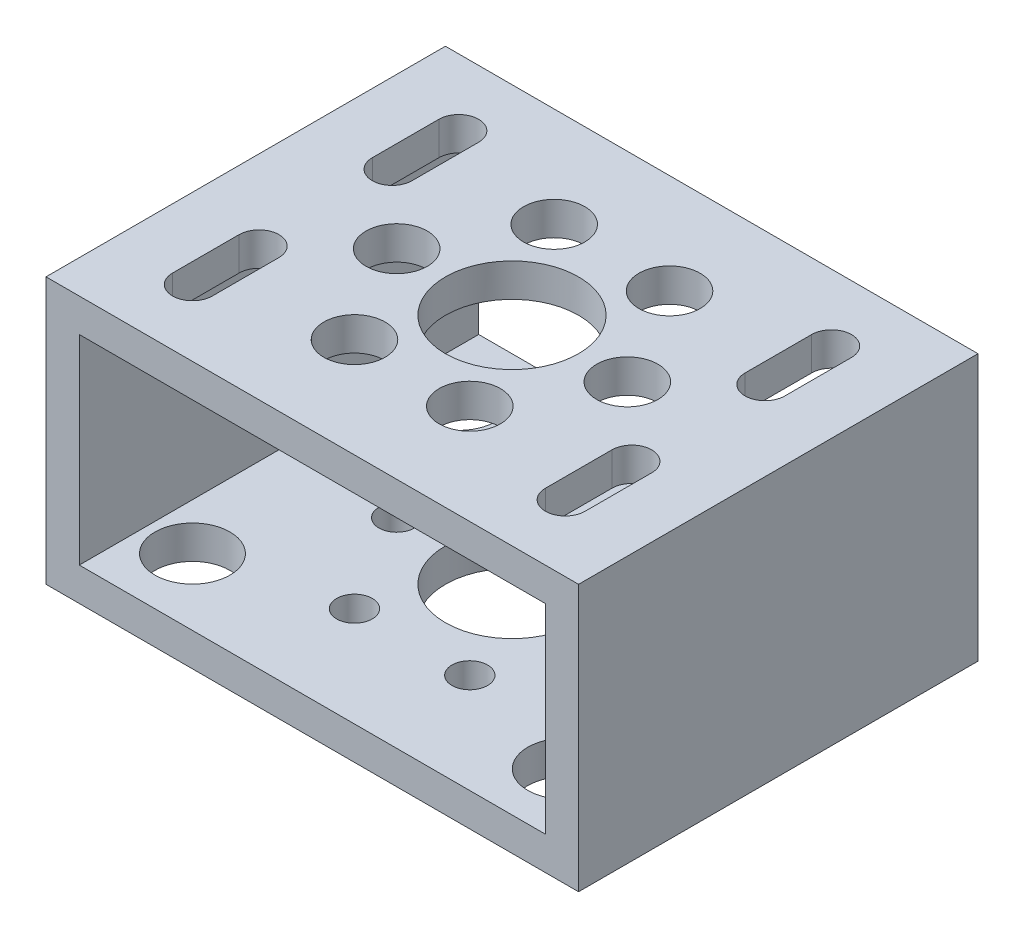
ISO-10303-21;
HEADER;
FILE_DESCRIPTION(('STEP AP214'),'2;1');
FILE_NAME('part.step','',(''),(''),'','','');
FILE_SCHEMA(('AUTOMOTIVE_DESIGN { 1 0 10303 214 1 1 1 1 }'));
ENDSEC;
DATA;
#1=APPLICATION_CONTEXT('core data for automotive mechanical design processes');
#2=APPLICATION_PROTOCOL_DEFINITION('international standard','automotive_design',2000,#1);
#3=PRODUCT_CONTEXT('',#1,'mechanical');
#4=PRODUCT('Part','Part','',(#3));
#5=PRODUCT_RELATED_PRODUCT_CATEGORY('part','',(#4));
#6=PRODUCT_DEFINITION_FORMATION('','',#4);
#7=PRODUCT_DEFINITION_CONTEXT('part definition',#1,'design');
#8=PRODUCT_DEFINITION('design','',#6,#7);
#9=PRODUCT_DEFINITION_SHAPE('','',#8);
#10=(LENGTH_UNIT() NAMED_UNIT(*) SI_UNIT(.MILLI.,.METRE.));
#11=(NAMED_UNIT(*) PLANE_ANGLE_UNIT() SI_UNIT($,.RADIAN.));
#12=(NAMED_UNIT(*) SI_UNIT($,.STERADIAN.) SOLID_ANGLE_UNIT());
#13=UNCERTAINTY_MEASURE_WITH_UNIT(LENGTH_MEASURE(1.E-05),#10,'distance_accuracy_value','');
#14=(GEOMETRIC_REPRESENTATION_CONTEXT(3) GLOBAL_UNCERTAINTY_ASSIGNED_CONTEXT((#13)) GLOBAL_UNIT_ASSIGNED_CONTEXT((#10,
#11,#12)) REPRESENTATION_CONTEXT('',''));
#15=CARTESIAN_POINT('',(0.,0.,0.));
#16=DIRECTION('',(0.,0.,1.));
#17=DIRECTION('',(1.,0.,0.));
#18=AXIS2_PLACEMENT_3D('',#15,#16,#17);
#19=CARTESIAN_POINT('',(17.78,-12.7,6.35));
#20=DIRECTION('',(0.,-1.,0.));
#21=DIRECTION('',(0.,0.,-1.));
#22=AXIS2_PLACEMENT_3D('',#19,#20,#21);
#23=CYLINDRICAL_SURFACE('',#22,1.89865);
#24=DIRECTION('',(0.,-1.,0.));
#25=VECTOR('',#24,1.);
#26=CARTESIAN_POINT('',(15.88135,-12.7,6.35));
#27=LINE('',#26,#25);
#28=CARTESIAN_POINT('',(15.88135,12.7,6.35));
#29=VERTEX_POINT('',#28);
#30=CARTESIAN_POINT('',(15.88135,9.525,6.35));
#31=VERTEX_POINT('',#30);
#32=EDGE_CURVE('E211',#29,#31,#27,.T.);
#33=ORIENTED_EDGE('',*,*,#32,.T.);
#34=CARTESIAN_POINT('',(17.78,9.525,6.35));
#35=DIRECTION('',(0.,-1.,0.));
#36=DIRECTION('',(0.,0.,-1.));
#37=AXIS2_PLACEMENT_3D('',#34,#35,#36);
#38=CIRCLE('',#37,1.89865);
#39=CARTESIAN_POINT('',(19.67865,9.525,6.35));
#40=VERTEX_POINT('',#39);
#41=EDGE_CURVE('E219',#31,#40,#38,.T.);
#42=ORIENTED_EDGE('',*,*,#41,.T.);
#43=DIRECTION('',(0.,-1.,0.));
#44=VECTOR('',#43,1.);
#45=CARTESIAN_POINT('',(19.67865,-12.7,6.35));
#46=LINE('',#45,#44);
#47=CARTESIAN_POINT('',(19.67865,12.7,6.35));
#48=VERTEX_POINT('',#47);
#49=EDGE_CURVE('E201',#48,#40,#46,.T.);
#50=ORIENTED_EDGE('',*,*,#49,.F.);
#51=CARTESIAN_POINT('',(17.78,12.7,6.35));
#52=DIRECTION('',(0.,-1.,0.));
#53=DIRECTION('',(0.,0.,-1.));
#54=AXIS2_PLACEMENT_3D('',#51,#52,#53);
#55=CIRCLE('',#54,1.89864999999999);
#56=EDGE_CURVE('E230',#29,#48,#55,.T.);
#57=ORIENTED_EDGE('',*,*,#56,.F.);
#58=EDGE_LOOP('',(#33,#42,#50,#57));
#59=FACE_BOUND('',#58,.T.);
#60=ADVANCED_FACE('F41',(#59),#23,.F.);
#61=CARTESIAN_POINT('',(-17.78,-12.7,31.75));
#62=DIRECTION('',(0.,-1.,0.));
#63=DIRECTION('',(0.,0.,-1.));
#64=AXIS2_PLACEMENT_3D('',#61,#62,#63);
#65=CYLINDRICAL_SURFACE('',#64,1.89865);
#66=DIRECTION('',(0.,-1.,0.));
#67=VECTOR('',#66,1.);
#68=CARTESIAN_POINT('',(-15.88135,-12.7,31.75));
#69=LINE('',#68,#67);
#70=CARTESIAN_POINT('',(-15.88135,12.7,31.75));
#71=VERTEX_POINT('',#70);
#72=CARTESIAN_POINT('',(-15.88135,9.525,31.75));
#73=VERTEX_POINT('',#72);
#74=EDGE_CURVE('E827',#71,#73,#69,.T.);
#75=ORIENTED_EDGE('',*,*,#74,.T.);
#76=CARTESIAN_POINT('',(-17.78,9.525,31.75));
#77=DIRECTION('',(0.,-1.,0.));
#78=DIRECTION('',(0.,0.,-1.));
#79=AXIS2_PLACEMENT_3D('',#76,#77,#78);
#80=CIRCLE('',#79,1.89865);
#81=CARTESIAN_POINT('',(-19.67865,9.525,31.75));
#82=VERTEX_POINT('',#81);
#83=EDGE_CURVE('E259',#73,#82,#80,.T.);
#84=ORIENTED_EDGE('',*,*,#83,.T.);
#85=DIRECTION('',(0.,-1.,0.));
#86=VECTOR('',#85,1.);
#87=CARTESIAN_POINT('',(-19.67865,-12.7,31.75));
#88=LINE('',#87,#86);
#89=CARTESIAN_POINT('',(-19.67865,12.7,31.75));
#90=VERTEX_POINT('',#89);
#91=EDGE_CURVE('E829',#90,#82,#88,.T.);
#92=ORIENTED_EDGE('',*,*,#91,.F.);
#93=CARTESIAN_POINT('',(-17.78,12.7,31.75));
#94=DIRECTION('',(0.,-1.,0.));
#95=DIRECTION('',(0.,0.,-1.));
#96=AXIS2_PLACEMENT_3D('',#93,#94,#95);
#97=CIRCLE('',#96,1.89864999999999);
#98=EDGE_CURVE('E227',#71,#90,#97,.T.);
#99=ORIENTED_EDGE('',*,*,#98,.F.);
#100=EDGE_LOOP('',(#75,#84,#92,#99));
#101=FACE_BOUND('',#100,.T.);
#102=ADVANCED_FACE('F472',(#101),#65,.F.);
#103=CARTESIAN_POINT('',(-17.78,-12.7,6.35));
#104=DIRECTION('',(0.,-1.,0.));
#105=DIRECTION('',(0.,0.,-1.));
#106=AXIS2_PLACEMENT_3D('',#103,#104,#105);
#107=CYLINDRICAL_SURFACE('',#106,1.89865);
#108=DIRECTION('',(0.,-1.,0.));
#109=VECTOR('',#108,1.);
#110=CARTESIAN_POINT('',(-19.67865,-12.7,6.35));
#111=LINE('',#110,#109);
#112=CARTESIAN_POINT('',(-19.67865,12.7,6.35));
#113=VERTEX_POINT('',#112);
#114=CARTESIAN_POINT('',(-19.67865,9.525,6.35));
#115=VERTEX_POINT('',#114);
#116=EDGE_CURVE('E852',#113,#115,#111,.T.);
#117=ORIENTED_EDGE('',*,*,#116,.T.);
#118=CARTESIAN_POINT('',(-17.78,9.525,6.35));
#119=DIRECTION('',(0.,-1.,0.));
#120=DIRECTION('',(0.,0.,-1.));
#121=AXIS2_PLACEMENT_3D('',#118,#119,#120);
#122=CIRCLE('',#121,1.89865);
#123=CARTESIAN_POINT('',(-15.88135,9.525,6.35));
#124=VERTEX_POINT('',#123);
#125=EDGE_CURVE('E235',#115,#124,#122,.T.);
#126=ORIENTED_EDGE('',*,*,#125,.T.);
#127=DIRECTION('',(0.,-1.,0.));
#128=VECTOR('',#127,1.);
#129=CARTESIAN_POINT('',(-15.88135,-12.7,6.35));
#130=LINE('',#129,#128);
#131=CARTESIAN_POINT('',(-15.88135,12.7,6.35));
#132=VERTEX_POINT('',#131);
#133=EDGE_CURVE('E854',#132,#124,#130,.T.);
#134=ORIENTED_EDGE('',*,*,#133,.F.);
#135=CARTESIAN_POINT('',(-17.78,12.7,6.35));
#136=DIRECTION('',(0.,-1.,0.));
#137=DIRECTION('',(0.,0.,-1.));
#138=AXIS2_PLACEMENT_3D('',#135,#136,#137);
#139=CIRCLE('',#138,1.89864999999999);
#140=EDGE_CURVE('E244',#113,#132,#139,.T.);
#141=ORIENTED_EDGE('',*,*,#140,.F.);
#142=EDGE_LOOP('',(#117,#126,#134,#141));
#143=FACE_BOUND('',#142,.T.);
#144=ADVANCED_FACE('F478',(#143),#107,.F.);
#145=CARTESIAN_POINT('',(-25.4,-12.7,38.1));
#146=DIRECTION('',(0.,0.,1.));
#147=DIRECTION('',(1.,0.,0.));
#148=AXIS2_PLACEMENT_3D('',#145,#146,#147);
#149=PLANE('',#148);
#150=DIRECTION('',(0.,-1.,0.));
#151=VECTOR('',#150,1.);
#152=CARTESIAN_POINT('',(-25.4,12.7,38.1));
#153=LINE('',#152,#151);
#154=CARTESIAN_POINT('',(-25.4,12.7,38.1));
#155=VERTEX_POINT('',#154);
#156=CARTESIAN_POINT('',(-25.4,-12.7,38.1));
#157=VERTEX_POINT('',#156);
#158=EDGE_CURVE('E390',#155,#157,#153,.T.);
#159=ORIENTED_EDGE('',*,*,#158,.T.);
#160=DIRECTION('',(1.,0.,0.));
#161=VECTOR('',#160,1.);
#162=CARTESIAN_POINT('',(-25.4,-12.7,38.1));
#163=LINE('',#162,#161);
#164=CARTESIAN_POINT('',(25.4,-12.7,38.1));
#165=VERTEX_POINT('',#164);
#166=EDGE_CURVE('E393',#157,#165,#163,.T.);
#167=ORIENTED_EDGE('',*,*,#166,.T.);
#168=DIRECTION('',(0.,1.,0.));
#169=VECTOR('',#168,1.);
#170=CARTESIAN_POINT('',(25.4,12.7,38.1));
#171=LINE('',#170,#169);
#172=CARTESIAN_POINT('',(25.4,12.7,38.1));
#173=VERTEX_POINT('',#172);
#174=EDGE_CURVE('E395',#165,#173,#171,.T.);
#175=ORIENTED_EDGE('',*,*,#174,.T.);
#176=DIRECTION('',(-1.,0.,0.));
#177=VECTOR('',#176,1.);
#178=CARTESIAN_POINT('',(-25.4,12.7,38.1));
#179=LINE('',#178,#177);
#180=EDGE_CURVE('E397',#173,#155,#179,.T.);
#181=ORIENTED_EDGE('',*,*,#180,.T.);
#182=EDGE_LOOP('',(#159,#167,#175,#181));
#183=FACE_BOUND('',#182,.T.);
#184=DIRECTION('',(1.,0.,0.));
#185=VECTOR('',#184,1.);
#186=CARTESIAN_POINT('',(-22.225,-9.525,38.1));
#187=LINE('',#186,#185);
#188=CARTESIAN_POINT('',(-22.225,-9.525,38.1));
#189=VERTEX_POINT('',#188);
#190=CARTESIAN_POINT('',(22.225,-9.525,38.1));
#191=VERTEX_POINT('',#190);
#192=EDGE_CURVE('E364',#189,#191,#187,.T.);
#193=ORIENTED_EDGE('',*,*,#192,.F.);
#194=DIRECTION('',(0.,-1.,0.));
#195=VECTOR('',#194,1.);
#196=CARTESIAN_POINT('',(-22.225,9.525,38.1));
#197=LINE('',#196,#195);
#198=CARTESIAN_POINT('',(-22.225,9.525,38.1));
#199=VERTEX_POINT('',#198);
#200=EDGE_CURVE('E362',#199,#189,#197,.T.);
#201=ORIENTED_EDGE('',*,*,#200,.F.);
#202=DIRECTION('',(-1.,0.,0.));
#203=VECTOR('',#202,1.);
#204=CARTESIAN_POINT('',(-22.225,9.525,38.1));
#205=LINE('',#204,#203);
#206=CARTESIAN_POINT('',(22.225,9.525,38.1));
#207=VERTEX_POINT('',#206);
#208=EDGE_CURVE('E369',#207,#199,#205,.T.);
#209=ORIENTED_EDGE('',*,*,#208,.F.);
#210=DIRECTION('',(0.,1.,0.));
#211=VECTOR('',#210,1.);
#212=CARTESIAN_POINT('',(22.225,9.525,38.1));
#213=LINE('',#212,#211);
#214=EDGE_CURVE('E366',#191,#207,#213,.T.);
#215=ORIENTED_EDGE('',*,*,#214,.F.);
#216=EDGE_LOOP('',(#193,#201,#209,#215));
#217=FACE_BOUND('',#216,.T.);
#218=ADVANCED_FACE('F459',(#183,#217),#149,.T.);
#219=CARTESIAN_POINT('',(-25.4,-12.7,0.));
#220=DIRECTION('',(0.,0.,1.));
#221=DIRECTION('',(1.,0.,0.));
#222=AXIS2_PLACEMENT_3D('',#219,#220,#221);
#223=PLANE('',#222);
#224=DIRECTION('',(0.,-1.,0.));
#225=VECTOR('',#224,1.);
#226=CARTESIAN_POINT('',(-25.4,12.7,0.));
#227=LINE('',#226,#225);
#228=CARTESIAN_POINT('',(-25.4,12.7,0.));
#229=VERTEX_POINT('',#228);
#230=CARTESIAN_POINT('',(-25.4,-12.7,0.));
#231=VERTEX_POINT('',#230);
#232=EDGE_CURVE('E381',#229,#231,#227,.T.);
#233=ORIENTED_EDGE('',*,*,#232,.F.);
#234=DIRECTION('',(-1.,0.,0.));
#235=VECTOR('',#234,1.);
#236=CARTESIAN_POINT('',(-25.4,12.7,0.));
#237=LINE('',#236,#235);
#238=CARTESIAN_POINT('',(25.4,12.7,0.));
#239=VERTEX_POINT('',#238);
#240=EDGE_CURVE('E388',#239,#229,#237,.T.);
#241=ORIENTED_EDGE('',*,*,#240,.F.);
#242=DIRECTION('',(0.,1.,0.));
#243=VECTOR('',#242,1.);
#244=CARTESIAN_POINT('',(25.4,12.7,0.));
#245=LINE('',#244,#243);
#246=CARTESIAN_POINT('',(25.4,-12.7,0.));
#247=VERTEX_POINT('',#246);
#248=EDGE_CURVE('E386',#247,#239,#245,.T.);
#249=ORIENTED_EDGE('',*,*,#248,.F.);
#250=DIRECTION('',(1.,0.,0.));
#251=VECTOR('',#250,1.);
#252=CARTESIAN_POINT('',(-25.4,-12.7,0.));
#253=LINE('',#252,#251);
#254=EDGE_CURVE('E384',#231,#247,#253,.T.);
#255=ORIENTED_EDGE('',*,*,#254,.F.);
#256=EDGE_LOOP('',(#233,#241,#249,#255));
#257=FACE_BOUND('',#256,.T.);
#258=DIRECTION('',(0.,-1.,0.));
#259=VECTOR('',#258,1.);
#260=CARTESIAN_POINT('',(-22.225,9.525,0.));
#261=LINE('',#260,#259);
#262=CARTESIAN_POINT('',(-22.225,9.525,0.));
#263=VERTEX_POINT('',#262);
#264=CARTESIAN_POINT('',(-22.225,-9.525,0.));
#265=VERTEX_POINT('',#264);
#266=EDGE_CURVE('E350',#263,#265,#261,.T.);
#267=ORIENTED_EDGE('',*,*,#266,.T.);
#268=DIRECTION('',(1.,0.,0.));
#269=VECTOR('',#268,1.);
#270=CARTESIAN_POINT('',(-22.225,-9.525,0.));
#271=LINE('',#270,#269);
#272=CARTESIAN_POINT('',(22.225,-9.525,0.));
#273=VERTEX_POINT('',#272);
#274=EDGE_CURVE('E353',#265,#273,#271,.T.);
#275=ORIENTED_EDGE('',*,*,#274,.T.);
#276=DIRECTION('',(0.,1.,0.));
#277=VECTOR('',#276,1.);
#278=CARTESIAN_POINT('',(22.225,9.525,0.));
#279=LINE('',#278,#277);
#280=CARTESIAN_POINT('',(22.225,9.525,0.));
#281=VERTEX_POINT('',#280);
#282=EDGE_CURVE('E356',#273,#281,#279,.T.);
#283=ORIENTED_EDGE('',*,*,#282,.T.);
#284=DIRECTION('',(-1.,0.,0.));
#285=VECTOR('',#284,1.);
#286=CARTESIAN_POINT('',(-22.225,9.525,0.));
#287=LINE('',#286,#285);
#288=EDGE_CURVE('E359',#281,#263,#287,.T.);
#289=ORIENTED_EDGE('',*,*,#288,.T.);
#290=EDGE_LOOP('',(#267,#275,#283,#289));
#291=FACE_BOUND('',#290,.T.);
#292=ADVANCED_FACE('F454',(#257,#291),#223,.F.);
#293=CARTESIAN_POINT('',(-25.4,12.7,38.1));
#294=DIRECTION('',(1.,0.,0.));
#295=DIRECTION('',(0.,1.,0.));
#296=AXIS2_PLACEMENT_3D('',#293,#294,#295);
#297=PLANE('',#296);
#298=ORIENTED_EDGE('',*,*,#232,.T.);
#299=DIRECTION('',(0.,0.,-1.));
#300=VECTOR('',#299,1.);
#301=CARTESIAN_POINT('',(-25.4,-12.7,38.1));
#302=LINE('',#301,#300);
#303=EDGE_CURVE('E13',#157,#231,#302,.T.);
#304=ORIENTED_EDGE('',*,*,#303,.F.);
#305=ORIENTED_EDGE('',*,*,#158,.F.);
#306=DIRECTION('',(0.,0.,-1.));
#307=VECTOR('',#306,1.);
#308=CARTESIAN_POINT('',(-25.4,12.7,38.1));
#309=LINE('',#308,#307);
#310=EDGE_CURVE('E399',#155,#229,#309,.T.);
#311=ORIENTED_EDGE('',*,*,#310,.T.);
#312=EDGE_LOOP('',(#298,#304,#305,#311));
#313=FACE_BOUND('',#312,.T.);
#314=ADVANCED_FACE('F43',(#313),#297,.F.);
#315=CARTESIAN_POINT('',(-25.4,-12.7,38.1));
#316=DIRECTION('',(0.,1.,0.));
#317=DIRECTION('',(0.,0.,1.));
#318=AXIS2_PLACEMENT_3D('',#315,#316,#317);
#319=PLANE('',#318);
#320=CARTESIAN_POINT('',(-17.78,-12.7,6.35));
#321=DIRECTION('',(0.,-1.,0.));
#322=DIRECTION('',(0.,0.,-1.));
#323=AXIS2_PLACEMENT_3D('',#320,#321,#322);
#324=CIRCLE('',#323,3.57251);
#325=CARTESIAN_POINT('',(-17.78,-12.7,2.77749));
#326=VERTEX_POINT('',#325);
#327=EDGE_CURVE('E237',#326,#326,#324,.T.);
#328=ORIENTED_EDGE('',*,*,#327,.F.);
#329=EDGE_LOOP('',(#328));
#330=FACE_BOUND('',#329,.T.);
#331=CARTESIAN_POINT('',(17.78,-12.7,6.35));
#332=DIRECTION('',(0.,-1.,0.));
#333=DIRECTION('',(0.,0.,-1.));
#334=AXIS2_PLACEMENT_3D('',#331,#332,#333);
#335=CIRCLE('',#334,3.57251);
#336=CARTESIAN_POINT('',(17.78,-12.7,2.77749));
#337=VERTEX_POINT('',#336);
#338=EDGE_CURVE('E224',#337,#337,#335,.T.);
#339=ORIENTED_EDGE('',*,*,#338,.F.);
#340=EDGE_LOOP('',(#339));
#341=FACE_BOUND('',#340,.T.);
#342=CARTESIAN_POINT('',(-17.78,-12.7,31.75));
#343=DIRECTION('',(0.,-1.,0.));
#344=DIRECTION('',(0.,0.,-1.));
#345=AXIS2_PLACEMENT_3D('',#342,#343,#344);
#346=CIRCLE('',#345,3.57251);
#347=CARTESIAN_POINT('',(-17.78,-12.7,28.17749));
#348=VERTEX_POINT('',#347);
#349=EDGE_CURVE('E256',#348,#348,#346,.T.);
#350=ORIENTED_EDGE('',*,*,#349,.F.);
#351=EDGE_LOOP('',(#350));
#352=FACE_BOUND('',#351,.T.);
#353=CARTESIAN_POINT('',(17.78,-12.7,31.75));
#354=DIRECTION('',(0.,-1.,0.));
#355=DIRECTION('',(0.,0.,-1.));
#356=AXIS2_PLACEMENT_3D('',#353,#354,#355);
#357=CIRCLE('',#356,3.57251);
#358=CARTESIAN_POINT('',(17.78,-12.7,28.17749));
#359=VERTEX_POINT('',#358);
#360=EDGE_CURVE('E263',#359,#359,#357,.T.);
#361=ORIENTED_EDGE('',*,*,#360,.F.);
#362=EDGE_LOOP('',(#361));
#363=FACE_BOUND('',#362,.T.);
#364=CARTESIAN_POINT('',(-5.50000000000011,-12.7,9.52372055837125));
#365=DIRECTION('',(0.,1.,0.));
#366=DIRECTION('',(0.,0.,1.));
#367=AXIS2_PLACEMENT_3D('',#364,#365,#366);
#368=CIRCLE('',#367,1.69999999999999);
#369=CARTESIAN_POINT('',(-5.50000000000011,-12.7,11.2237205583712));
#370=VERTEX_POINT('',#369);
#371=EDGE_CURVE('E301',#370,#370,#368,.T.);
#372=ORIENTED_EDGE('',*,*,#371,.T.);
#373=EDGE_LOOP('',(#372));
#374=FACE_BOUND('',#373,.T.);
#375=CARTESIAN_POINT('',(5.49999999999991,-12.7,9.52372055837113));
#376=DIRECTION('',(0.,1.,0.));
#377=DIRECTION('',(0.,0.,1.));
#378=AXIS2_PLACEMENT_3D('',#375,#376,#377);
#379=CIRCLE('',#378,1.69999999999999);
#380=CARTESIAN_POINT('',(5.49999999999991,-12.7,11.2237205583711));
#381=VERTEX_POINT('',#380);
#382=EDGE_CURVE('E307',#381,#381,#379,.T.);
#383=ORIENTED_EDGE('',*,*,#382,.T.);
#384=EDGE_LOOP('',(#383));
#385=FACE_BOUND('',#384,.T.);
#386=CARTESIAN_POINT('',(11.,-12.7,19.0499999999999));
#387=DIRECTION('',(0.,1.,0.));
#388=DIRECTION('',(0.,0.,1.));
#389=AXIS2_PLACEMENT_3D('',#386,#387,#388);
#390=CIRCLE('',#389,1.69999999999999);
#391=CARTESIAN_POINT('',(11.,-12.7,20.7499999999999));
#392=VERTEX_POINT('',#391);
#393=EDGE_CURVE('E313',#392,#392,#390,.T.);
#394=ORIENTED_EDGE('',*,*,#393,.T.);
#395=EDGE_LOOP('',(#394));
#396=FACE_BOUND('',#395,.T.);
#397=CARTESIAN_POINT('',(5.50000000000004,-12.7,28.5762794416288));
#398=DIRECTION('',(0.,1.,0.));
#399=DIRECTION('',(0.,0.,1.));
#400=AXIS2_PLACEMENT_3D('',#397,#398,#399);
#401=CIRCLE('',#400,1.69999999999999);
#402=CARTESIAN_POINT('',(5.50000000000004,-12.7,30.2762794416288));
#403=VERTEX_POINT('',#402);
#404=EDGE_CURVE('E319',#403,#403,#401,.T.);
#405=ORIENTED_EDGE('',*,*,#404,.T.);
#406=EDGE_LOOP('',(#405));
#407=FACE_BOUND('',#406,.T.);
#408=CARTESIAN_POINT('',(-5.49999999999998,-12.7,28.5762794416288));
#409=DIRECTION('',(0.,1.,0.));
#410=DIRECTION('',(0.,0.,1.));
#411=AXIS2_PLACEMENT_3D('',#408,#409,#410);
#412=CIRCLE('',#411,1.69999999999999);
#413=CARTESIAN_POINT('',(-5.49999999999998,-12.7,30.2762794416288));
#414=VERTEX_POINT('',#413);
#415=EDGE_CURVE('E325',#414,#414,#412,.T.);
#416=ORIENTED_EDGE('',*,*,#415,.T.);
#417=EDGE_LOOP('',(#416));
#418=FACE_BOUND('',#417,.T.);
#419=CARTESIAN_POINT('',(-11.,-12.7,19.05));
#420=DIRECTION('',(0.,1.,0.));
#421=DIRECTION('',(0.,0.,1.));
#422=AXIS2_PLACEMENT_3D('',#419,#420,#421);
#423=CIRCLE('',#422,1.69999999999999);
#424=CARTESIAN_POINT('',(-11.,-12.7,20.75));
#425=VERTEX_POINT('',#424);
#426=EDGE_CURVE('E337',#425,#425,#423,.T.);
#427=ORIENTED_EDGE('',*,*,#426,.T.);
#428=EDGE_LOOP('',(#427));
#429=FACE_BOUND('',#428,.T.);
#430=CARTESIAN_POINT('',(0.,-12.7,19.05));
#431=DIRECTION('',(0.,1.,0.));
#432=DIRECTION('',(0.,0.,1.));
#433=AXIS2_PLACEMENT_3D('',#430,#431,#432);
#434=CIRCLE('',#433,6.35);
#435=CARTESIAN_POINT('',(0.,-12.7,25.4));
#436=VERTEX_POINT('',#435);
#437=EDGE_CURVE('E343',#436,#436,#434,.T.);
#438=ORIENTED_EDGE('',*,*,#437,.T.);
#439=EDGE_LOOP('',(#438));
#440=FACE_BOUND('',#439,.T.);
#441=ORIENTED_EDGE('',*,*,#254,.T.);
#442=DIRECTION('',(0.,0.,-1.));
#443=VECTOR('',#442,1.);
#444=CARTESIAN_POINT('',(25.4,-12.7,38.1));
#445=LINE('',#444,#443);
#446=EDGE_CURVE('E50',#165,#247,#445,.T.);
#447=ORIENTED_EDGE('',*,*,#446,.F.);
#448=ORIENTED_EDGE('',*,*,#166,.F.);
#449=ORIENTED_EDGE('',*,*,#303,.T.);
#450=EDGE_LOOP('',(#441,#447,#448,#449));
#451=FACE_BOUND('',#450,.T.);
#452=ADVANCED_FACE('F574',(#330,#341,#352,#363,#374,#385,#396,#407,#418,#429,#440,#451),#319,.F.);
#453=CARTESIAN_POINT('',(25.4,12.7,38.1));
#454=DIRECTION('',(-1.,0.,0.));
#455=DIRECTION('',(0.,-1.,0.));
#456=AXIS2_PLACEMENT_3D('',#453,#454,#455);
#457=PLANE('',#456);
#458=ORIENTED_EDGE('',*,*,#248,.T.);
#459=DIRECTION('',(0.,0.,-1.));
#460=VECTOR('',#459,1.);
#461=CARTESIAN_POINT('',(25.4,12.7,38.1));
#462=LINE('',#461,#460);
#463=EDGE_CURVE('E402',#173,#239,#462,.T.);
#464=ORIENTED_EDGE('',*,*,#463,.F.);
#465=ORIENTED_EDGE('',*,*,#174,.F.);
#466=ORIENTED_EDGE('',*,*,#446,.T.);
#467=EDGE_LOOP('',(#458,#464,#465,#466));
#468=FACE_BOUND('',#467,.T.);
#469=ADVANCED_FACE('F559',(#468),#457,.F.);
#470=CARTESIAN_POINT('',(-25.4,12.7,38.1));
#471=DIRECTION('',(0.,-1.,0.));
#472=DIRECTION('',(0.,0.,-1.));
#473=AXIS2_PLACEMENT_3D('',#470,#471,#472);
#474=PLANE('',#473);
#475=CARTESIAN_POINT('',(17.78,12.7,31.75));
#476=DIRECTION('',(0.,-1.,0.));
#477=DIRECTION('',(0.,0.,-1.));
#478=AXIS2_PLACEMENT_3D('',#475,#476,#477);
#479=CIRCLE('',#478,1.89864999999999);
#480=CARTESIAN_POINT('',(19.67865,12.7,31.75));
#481=VERTEX_POINT('',#480);
#482=CARTESIAN_POINT('',(15.88135,12.7,31.75));
#483=VERTEX_POINT('',#482);
#484=EDGE_CURVE('E260',#481,#483,#479,.T.);
#485=ORIENTED_EDGE('',*,*,#484,.T.);
#486=DIRECTION('',(0.,0.,1.));
#487=VECTOR('',#486,1.);
#488=CARTESIAN_POINT('',(15.88135,12.7,25.4));
#489=LINE('',#488,#487);
#490=CARTESIAN_POINT('',(15.88135,12.7,25.4));
#491=VERTEX_POINT('',#490);
#492=EDGE_CURVE('E815',#491,#483,#489,.T.);
#493=ORIENTED_EDGE('',*,*,#492,.F.);
#494=CARTESIAN_POINT('',(17.78,12.7,25.4));
#495=DIRECTION('',(0.,1.,0.));
#496=DIRECTION('',(0.,0.,1.));
#497=AXIS2_PLACEMENT_3D('',#494,#495,#496);
#498=CIRCLE('',#497,1.89864999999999);
#499=CARTESIAN_POINT('',(19.67865,12.7,25.4));
#500=VERTEX_POINT('',#499);
#501=EDGE_CURVE('E812',#500,#491,#498,.T.);
#502=ORIENTED_EDGE('',*,*,#501,.F.);
#503=DIRECTION('',(0.,0.,-1.));
#504=VECTOR('',#503,1.);
#505=CARTESIAN_POINT('',(19.67865,12.7,31.75));
#506=LINE('',#505,#504);
#507=EDGE_CURVE('E817',#481,#500,#506,.T.);
#508=ORIENTED_EDGE('',*,*,#507,.F.);
#509=EDGE_LOOP('',(#485,#493,#502,#508));
#510=FACE_BOUND('',#509,.T.);
#511=CARTESIAN_POINT('',(-17.78,12.7,12.7));
#512=DIRECTION('',(0.,1.,0.));
#513=DIRECTION('',(0.,0.,1.));
#514=AXIS2_PLACEMENT_3D('',#511,#512,#513);
#515=CIRCLE('',#514,1.89864999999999);
#516=CARTESIAN_POINT('',(-19.67865,12.7,12.7));
#517=VERTEX_POINT('',#516);
#518=CARTESIAN_POINT('',(-15.88135,12.7,12.7));
#519=VERTEX_POINT('',#518);
#520=EDGE_CURVE('E865',#517,#519,#515,.T.);
#521=ORIENTED_EDGE('',*,*,#520,.F.);
#522=DIRECTION('',(0.,0.,1.));
#523=VECTOR('',#522,1.);
#524=CARTESIAN_POINT('',(-19.67865,12.7,6.35));
#525=LINE('',#524,#523);
#526=EDGE_CURVE('E862',#113,#517,#525,.T.);
#527=ORIENTED_EDGE('',*,*,#526,.F.);
#528=ORIENTED_EDGE('',*,*,#140,.T.);
#529=DIRECTION('',(0.,0.,-1.));
#530=VECTOR('',#529,1.);
#531=CARTESIAN_POINT('',(-15.88135,12.7,12.7));
#532=LINE('',#531,#530);
#533=EDGE_CURVE('E868',#519,#132,#532,.T.);
#534=ORIENTED_EDGE('',*,*,#533,.F.);
#535=EDGE_LOOP('',(#521,#527,#528,#534));
#536=FACE_BOUND('',#535,.T.);
#537=CARTESIAN_POINT('',(17.78,12.7,12.7));
#538=DIRECTION('',(0.,1.,0.));
#539=DIRECTION('',(0.,0.,-1.));
#540=AXIS2_PLACEMENT_3D('',#537,#538,#539);
#541=CIRCLE('',#540,1.89864999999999);
#542=CARTESIAN_POINT('',(15.88135,12.7,12.7));
#543=VERTEX_POINT('',#542);
#544=CARTESIAN_POINT('',(19.67865,12.7,12.7));
#545=VERTEX_POINT('',#544);
#546=EDGE_CURVE('E791',#543,#545,#541,.T.);
#547=ORIENTED_EDGE('',*,*,#546,.F.);
#548=DIRECTION('',(0.,0.,1.));
#549=VECTOR('',#548,1.);
#550=CARTESIAN_POINT('',(15.88135,12.7,12.7));
#551=LINE('',#550,#549);
#552=EDGE_CURVE('E220',#29,#543,#551,.T.);
#553=ORIENTED_EDGE('',*,*,#552,.F.);
#554=ORIENTED_EDGE('',*,*,#56,.T.);
#555=DIRECTION('',(0.,0.,-1.));
#556=VECTOR('',#555,1.);
#557=CARTESIAN_POINT('',(19.67865,12.7,6.35));
#558=LINE('',#557,#556);
#559=EDGE_CURVE('E58',#545,#48,#558,.T.);
#560=ORIENTED_EDGE('',*,*,#559,.F.);
#561=EDGE_LOOP('',(#547,#553,#554,#560));
#562=FACE_BOUND('',#561,.T.);
#563=CARTESIAN_POINT('',(-17.78,12.7,25.4));
#564=DIRECTION('',(0.,1.,0.));
#565=DIRECTION('',(0.,0.,-1.));
#566=AXIS2_PLACEMENT_3D('',#563,#564,#565);
#567=CIRCLE('',#566,1.89864999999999);
#568=CARTESIAN_POINT('',(-15.88135,12.7,25.4));
#569=VERTEX_POINT('',#568);
#570=CARTESIAN_POINT('',(-19.67865,12.7,25.4));
#571=VERTEX_POINT('',#570);
#572=EDGE_CURVE('E840',#569,#571,#567,.T.);
#573=ORIENTED_EDGE('',*,*,#572,.F.);
#574=DIRECTION('',(0.,0.,-1.));
#575=VECTOR('',#574,1.);
#576=CARTESIAN_POINT('',(-15.88135,12.7,25.4));
#577=LINE('',#576,#575);
#578=EDGE_CURVE('E837',#71,#569,#577,.T.);
#579=ORIENTED_EDGE('',*,*,#578,.F.);
#580=ORIENTED_EDGE('',*,*,#98,.T.);
#581=DIRECTION('',(0.,0.,1.));
#582=VECTOR('',#581,1.);
#583=CARTESIAN_POINT('',(-19.67865,12.7,31.75));
#584=LINE('',#583,#582);
#585=EDGE_CURVE('E843',#571,#90,#584,.T.);
#586=ORIENTED_EDGE('',*,*,#585,.F.);
#587=EDGE_LOOP('',(#573,#579,#580,#586));
#588=FACE_BOUND('',#587,.T.);
#589=CARTESIAN_POINT('',(-5.50000000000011,12.7,9.52372055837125));
#590=DIRECTION('',(0.,1.,0.));
#591=DIRECTION('',(-0.866025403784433,0.,0.50000000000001));
#592=AXIS2_PLACEMENT_3D('',#589,#590,#591);
#593=CIRCLE('',#592,2.921);
#594=CARTESIAN_POINT('',(-5.50000000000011,12.7,12.4447205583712));
#595=VERTEX_POINT('',#594);
#596=EDGE_CURVE('E267',#595,#595,#593,.T.);
#597=ORIENTED_EDGE('',*,*,#596,.F.);
#598=EDGE_LOOP('',(#597));
#599=FACE_BOUND('',#598,.T.);
#600=CARTESIAN_POINT('',(5.49999999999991,12.7,9.52372055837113));
#601=DIRECTION('',(0.,1.,0.));
#602=DIRECTION('',(-0.866025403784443,0.,-0.499999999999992));
#603=AXIS2_PLACEMENT_3D('',#600,#601,#602);
#604=CIRCLE('',#603,2.921);
#605=CARTESIAN_POINT('',(5.49999999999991,12.7,12.4447205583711));
#606=VERTEX_POINT('',#605);
#607=EDGE_CURVE('E275',#606,#606,#604,.T.);
#608=ORIENTED_EDGE('',*,*,#607,.F.);
#609=EDGE_LOOP('',(#608));
#610=FACE_BOUND('',#609,.T.);
#611=CARTESIAN_POINT('',(11.,12.7,19.0499999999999));
#612=DIRECTION('',(0.,1.,0.));
#613=DIRECTION('',(0.,0.,-1.));
#614=AXIS2_PLACEMENT_3D('',#611,#612,#613);
#615=CIRCLE('',#614,2.921);
#616=CARTESIAN_POINT('',(11.,12.7,21.9709999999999));
#617=VERTEX_POINT('',#616);
#618=EDGE_CURVE('E281',#617,#617,#615,.T.);
#619=ORIENTED_EDGE('',*,*,#618,.F.);
#620=EDGE_LOOP('',(#619));
#621=FACE_BOUND('',#620,.T.);
#622=CARTESIAN_POINT('',(5.50000000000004,12.7,28.5762794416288));
#623=DIRECTION('',(0.,1.,0.));
#624=DIRECTION('',(0.866025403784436,0.,-0.500000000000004));
#625=AXIS2_PLACEMENT_3D('',#622,#623,#624);
#626=CIRCLE('',#625,2.921);
#627=CARTESIAN_POINT('',(5.50000000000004,12.7,31.4972794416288));
#628=VERTEX_POINT('',#627);
#629=EDGE_CURVE('E287',#628,#628,#626,.T.);
#630=ORIENTED_EDGE('',*,*,#629,.F.);
#631=EDGE_LOOP('',(#630));
#632=FACE_BOUND('',#631,.T.);
#633=CARTESIAN_POINT('',(-5.49999999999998,12.7,28.5762794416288));
#634=DIRECTION('',(0.,1.,0.));
#635=DIRECTION('',(0.86602540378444,0.,0.499999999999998));
#636=AXIS2_PLACEMENT_3D('',#633,#634,#635);
#637=CIRCLE('',#636,2.921);
#638=CARTESIAN_POINT('',(-5.49999999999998,12.7,31.4972794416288));
#639=VERTEX_POINT('',#638);
#640=EDGE_CURVE('E293',#639,#639,#637,.T.);
#641=ORIENTED_EDGE('',*,*,#640,.F.);
#642=EDGE_LOOP('',(#641));
#643=FACE_BOUND('',#642,.T.);
#644=CARTESIAN_POINT('',(-11.,12.7,19.05));
#645=DIRECTION('',(0.,1.,0.));
#646=DIRECTION('',(0.,0.,1.));
#647=AXIS2_PLACEMENT_3D('',#644,#645,#646);
#648=CIRCLE('',#647,2.921);
#649=CARTESIAN_POINT('',(-11.,12.7,21.971));
#650=VERTEX_POINT('',#649);
#651=EDGE_CURVE('E329',#650,#650,#648,.T.);
#652=ORIENTED_EDGE('',*,*,#651,.F.);
#653=EDGE_LOOP('',(#652));
#654=FACE_BOUND('',#653,.T.);
#655=CARTESIAN_POINT('',(0.,12.7,19.05));
#656=DIRECTION('',(0.,1.,0.));
#657=DIRECTION('',(0.,0.,1.));
#658=AXIS2_PLACEMENT_3D('',#655,#656,#657);
#659=CIRCLE('',#658,6.35);
#660=CARTESIAN_POINT('',(0.,12.7,25.4));
#661=VERTEX_POINT('',#660);
#662=EDGE_CURVE('E340',#661,#661,#659,.T.);
#663=ORIENTED_EDGE('',*,*,#662,.F.);
#664=EDGE_LOOP('',(#663));
#665=FACE_BOUND('',#664,.T.);
#666=ORIENTED_EDGE('',*,*,#240,.T.);
#667=ORIENTED_EDGE('',*,*,#310,.F.);
#668=ORIENTED_EDGE('',*,*,#180,.F.);
#669=ORIENTED_EDGE('',*,*,#463,.T.);
#670=EDGE_LOOP('',(#666,#667,#668,#669));
#671=FACE_BOUND('',#670,.T.);
#672=ADVANCED_FACE('F556',(#510,#536,#562,#588,#599,#610,#621,#632,#643,#654,#665,#671),#474,.F.);
#673=CARTESIAN_POINT('',(-22.225,9.525,38.1));
#674=DIRECTION('',(1.,0.,0.));
#675=DIRECTION('',(0.,1.,0.));
#676=AXIS2_PLACEMENT_3D('',#673,#674,#675);
#677=PLANE('',#676);
#678=ORIENTED_EDGE('',*,*,#266,.F.);
#679=DIRECTION('',(0.,0.,-1.));
#680=VECTOR('',#679,1.);
#681=CARTESIAN_POINT('',(-22.225,9.525,38.1));
#682=LINE('',#681,#680);
#683=EDGE_CURVE('E371',#199,#263,#682,.T.);
#684=ORIENTED_EDGE('',*,*,#683,.F.);
#685=ORIENTED_EDGE('',*,*,#200,.T.);
#686=DIRECTION('',(0.,0.,-1.));
#687=VECTOR('',#686,1.);
#688=CARTESIAN_POINT('',(-22.225,-9.525,38.1));
#689=LINE('',#688,#687);
#690=EDGE_CURVE('E378',#189,#265,#689,.T.);
#691=ORIENTED_EDGE('',*,*,#690,.T.);
#692=EDGE_LOOP('',(#678,#684,#685,#691));
#693=FACE_BOUND('',#692,.T.);
#694=ADVANCED_FACE('F427',(#693),#677,.T.);
#695=CARTESIAN_POINT('',(-22.225,-9.525,38.1));
#696=DIRECTION('',(0.,1.,0.));
#697=DIRECTION('',(-1.,0.,0.));
#698=AXIS2_PLACEMENT_3D('',#695,#696,#697);
#699=PLANE('',#698);
#700=CARTESIAN_POINT('',(-17.78,-9.525,6.35));
#701=DIRECTION('',(0.,1.,0.));
#702=DIRECTION('',(-1.,0.,0.));
#703=AXIS2_PLACEMENT_3D('',#700,#701,#702);
#704=CIRCLE('',#703,3.57251);
#705=CARTESIAN_POINT('',(-21.35251,-9.525,6.35));
#706=VERTEX_POINT('',#705);
#707=EDGE_CURVE('E45',#706,#706,#704,.T.);
#708=ORIENTED_EDGE('',*,*,#707,.F.);
#709=EDGE_LOOP('',(#708));
#710=FACE_BOUND('',#709,.T.);
#711=CARTESIAN_POINT('',(17.78,-9.525,6.35));
#712=DIRECTION('',(0.,1.,0.));
#713=DIRECTION('',(-1.,0.,0.));
#714=AXIS2_PLACEMENT_3D('',#711,#712,#713);
#715=CIRCLE('',#714,3.57251);
#716=CARTESIAN_POINT('',(14.20749,-9.525,6.35));
#717=VERTEX_POINT('',#716);
#718=EDGE_CURVE('E223',#717,#717,#715,.T.);
#719=ORIENTED_EDGE('',*,*,#718,.F.);
#720=EDGE_LOOP('',(#719));
#721=FACE_BOUND('',#720,.T.);
#722=CARTESIAN_POINT('',(-17.78,-9.525,31.75));
#723=DIRECTION('',(0.,1.,0.));
#724=DIRECTION('',(-1.,0.,0.));
#725=AXIS2_PLACEMENT_3D('',#722,#723,#724);
#726=CIRCLE('',#725,3.57251);
#727=CARTESIAN_POINT('',(-21.35251,-9.525,31.75));
#728=VERTEX_POINT('',#727);
#729=EDGE_CURVE('E233',#728,#728,#726,.T.);
#730=ORIENTED_EDGE('',*,*,#729,.F.);
#731=EDGE_LOOP('',(#730));
#732=FACE_BOUND('',#731,.T.);
#733=CARTESIAN_POINT('',(17.78,-9.525,31.75));
#734=DIRECTION('',(0.,1.,0.));
#735=DIRECTION('',(-1.,0.,0.));
#736=AXIS2_PLACEMENT_3D('',#733,#734,#735);
#737=CIRCLE('',#736,3.57251);
#738=CARTESIAN_POINT('',(14.20749,-9.525,31.75));
#739=VERTEX_POINT('',#738);
#740=EDGE_CURVE('E274',#739,#739,#737,.T.);
#741=ORIENTED_EDGE('',*,*,#740,.F.);
#742=EDGE_LOOP('',(#741));
#743=FACE_BOUND('',#742,.T.);
#744=CARTESIAN_POINT('',(-5.50000000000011,-9.525,9.52372055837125));
#745=DIRECTION('',(0.,1.,0.));
#746=DIRECTION('',(-1.,0.,0.));
#747=AXIS2_PLACEMENT_3D('',#744,#745,#746);
#748=CIRCLE('',#747,1.69999999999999);
#749=CARTESIAN_POINT('',(-5.50000000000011,-9.525,11.2237205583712));
#750=VERTEX_POINT('',#749);
#751=EDGE_CURVE('E296',#750,#750,#748,.T.);
#752=ORIENTED_EDGE('',*,*,#751,.F.);
#753=EDGE_LOOP('',(#752));
#754=FACE_BOUND('',#753,.T.);
#755=CARTESIAN_POINT('',(5.49999999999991,-9.525,9.52372055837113));
#756=DIRECTION('',(0.,1.,0.));
#757=DIRECTION('',(-1.,0.,0.));
#758=AXIS2_PLACEMENT_3D('',#755,#756,#757);
#759=CIRCLE('',#758,1.69999999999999);
#760=CARTESIAN_POINT('',(5.49999999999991,-9.525,11.2237205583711));
#761=VERTEX_POINT('',#760);
#762=EDGE_CURVE('E304',#761,#761,#759,.T.);
#763=ORIENTED_EDGE('',*,*,#762,.F.);
#764=EDGE_LOOP('',(#763));
#765=FACE_BOUND('',#764,.T.);
#766=CARTESIAN_POINT('',(11.,-9.525,19.0499999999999));
#767=DIRECTION('',(0.,1.,0.));
#768=DIRECTION('',(-1.,0.,0.));
#769=AXIS2_PLACEMENT_3D('',#766,#767,#768);
#770=CIRCLE('',#769,1.69999999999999);
#771=CARTESIAN_POINT('',(11.,-9.525,20.7499999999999));
#772=VERTEX_POINT('',#771);
#773=EDGE_CURVE('E310',#772,#772,#770,.T.);
#774=ORIENTED_EDGE('',*,*,#773,.F.);
#775=EDGE_LOOP('',(#774));
#776=FACE_BOUND('',#775,.T.);
#777=CARTESIAN_POINT('',(5.50000000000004,-9.525,28.5762794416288));
#778=DIRECTION('',(0.,1.,0.));
#779=DIRECTION('',(-1.,0.,0.));
#780=AXIS2_PLACEMENT_3D('',#777,#778,#779);
#781=CIRCLE('',#780,1.69999999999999);
#782=CARTESIAN_POINT('',(5.50000000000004,-9.525,30.2762794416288));
#783=VERTEX_POINT('',#782);
#784=EDGE_CURVE('E316',#783,#783,#781,.T.);
#785=ORIENTED_EDGE('',*,*,#784,.F.);
#786=EDGE_LOOP('',(#785));
#787=FACE_BOUND('',#786,.T.);
#788=CARTESIAN_POINT('',(-5.49999999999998,-9.525,28.5762794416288));
#789=DIRECTION('',(0.,1.,0.));
#790=DIRECTION('',(-1.,0.,0.));
#791=AXIS2_PLACEMENT_3D('',#788,#789,#790);
#792=CIRCLE('',#791,1.69999999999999);
#793=CARTESIAN_POINT('',(-5.49999999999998,-9.525,30.2762794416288));
#794=VERTEX_POINT('',#793);
#795=EDGE_CURVE('E322',#794,#794,#792,.T.);
#796=ORIENTED_EDGE('',*,*,#795,.F.);
#797=EDGE_LOOP('',(#796));
#798=FACE_BOUND('',#797,.T.);
#799=CARTESIAN_POINT('',(-11.,-9.525,19.05));
#800=DIRECTION('',(0.,1.,0.));
#801=DIRECTION('',(-1.,0.,0.));
#802=AXIS2_PLACEMENT_3D('',#799,#800,#801);
#803=CIRCLE('',#802,1.69999999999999);
#804=CARTESIAN_POINT('',(-11.,-9.525,20.75));
#805=VERTEX_POINT('',#804);
#806=EDGE_CURVE('E332',#805,#805,#803,.T.);
#807=ORIENTED_EDGE('',*,*,#806,.F.);
#808=EDGE_LOOP('',(#807));
#809=FACE_BOUND('',#808,.T.);
#810=CARTESIAN_POINT('',(0.,-9.525,19.05));
#811=DIRECTION('',(0.,1.,0.));
#812=DIRECTION('',(-1.,0.,0.));
#813=AXIS2_PLACEMENT_3D('',#810,#811,#812);
#814=CIRCLE('',#813,6.35);
#815=CARTESIAN_POINT('',(-6.35,-9.525,19.05));
#816=VERTEX_POINT('',#815);
#817=EDGE_CURVE('E347',#816,#816,#814,.T.);
#818=ORIENTED_EDGE('',*,*,#817,.F.);
#819=EDGE_LOOP('',(#818));
#820=FACE_BOUND('',#819,.T.);
#821=ORIENTED_EDGE('',*,*,#274,.F.);
#822=ORIENTED_EDGE('',*,*,#690,.F.);
#823=ORIENTED_EDGE('',*,*,#192,.T.);
#824=DIRECTION('',(0.,0.,-1.));
#825=VECTOR('',#824,1.);
#826=CARTESIAN_POINT('',(22.225,-9.525,38.1));
#827=LINE('',#826,#825);
#828=EDGE_CURVE('E376',#191,#273,#827,.T.);
#829=ORIENTED_EDGE('',*,*,#828,.T.);
#830=EDGE_LOOP('',(#821,#822,#823,#829));
#831=FACE_BOUND('',#830,.T.);
#832=ADVANCED_FACE('F423',(#710,#721,#732,#743,#754,#765,#776,#787,#798,#809,#820,#831),#699,.T.);
#833=CARTESIAN_POINT('',(22.225,9.525,38.1));
#834=DIRECTION('',(-1.,0.,0.));
#835=DIRECTION('',(0.,-1.,0.));
#836=AXIS2_PLACEMENT_3D('',#833,#834,#835);
#837=PLANE('',#836);
#838=ORIENTED_EDGE('',*,*,#282,.F.);
#839=ORIENTED_EDGE('',*,*,#828,.F.);
#840=ORIENTED_EDGE('',*,*,#214,.T.);
#841=DIRECTION('',(0.,0.,-1.));
#842=VECTOR('',#841,1.);
#843=CARTESIAN_POINT('',(22.225,9.525,38.1));
#844=LINE('',#843,#842);
#845=EDGE_CURVE('E374',#207,#281,#844,.T.);
#846=ORIENTED_EDGE('',*,*,#845,.T.);
#847=EDGE_LOOP('',(#838,#839,#840,#846));
#848=FACE_BOUND('',#847,.T.);
#849=ADVANCED_FACE('F426',(#848),#837,.T.);
#850=CARTESIAN_POINT('',(-22.225,9.525,38.1));
#851=DIRECTION('',(0.,-1.,0.));
#852=DIRECTION('',(0.,0.,-1.));
#853=AXIS2_PLACEMENT_3D('',#850,#851,#852);
#854=PLANE('',#853);
#855=DIRECTION('',(0.,0.,1.));
#856=VECTOR('',#855,1.);
#857=CARTESIAN_POINT('',(15.88135,9.525,12.7));
#858=LINE('',#857,#856);
#859=CARTESIAN_POINT('',(15.88135,9.525,12.7));
#860=VERTEX_POINT('',#859);
#861=EDGE_CURVE('E801',#31,#860,#858,.T.);
#862=ORIENTED_EDGE('',*,*,#861,.T.);
#863=CARTESIAN_POINT('',(17.78,9.525,12.7));
#864=DIRECTION('',(0.,-1.,0.));
#865=DIRECTION('',(0.,0.,-1.));
#866=AXIS2_PLACEMENT_3D('',#863,#864,#865);
#867=CIRCLE('',#866,1.89864999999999);
#868=CARTESIAN_POINT('',(19.67865,9.525,12.7));
#869=VERTEX_POINT('',#868);
#870=EDGE_CURVE('E210',#860,#869,#867,.F.);
#871=ORIENTED_EDGE('',*,*,#870,.T.);
#872=DIRECTION('',(0.,0.,-1.));
#873=VECTOR('',#872,1.);
#874=CARTESIAN_POINT('',(19.67865,9.525,6.35));
#875=LINE('',#874,#873);
#876=EDGE_CURVE('E204',#869,#40,#875,.T.);
#877=ORIENTED_EDGE('',*,*,#876,.T.);
#878=ORIENTED_EDGE('',*,*,#41,.F.);
#879=EDGE_LOOP('',(#862,#871,#877,#878));
#880=FACE_BOUND('',#879,.T.);
#881=DIRECTION('',(0.,0.,1.));
#882=VECTOR('',#881,1.);
#883=CARTESIAN_POINT('',(15.88135,9.525,25.4));
#884=LINE('',#883,#882);
#885=CARTESIAN_POINT('',(15.88135,9.52499999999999,25.4));
#886=VERTEX_POINT('',#885);
#887=CARTESIAN_POINT('',(15.88135,9.525,31.75));
#888=VERTEX_POINT('',#887);
#889=EDGE_CURVE('E823',#886,#888,#884,.T.);
#890=ORIENTED_EDGE('',*,*,#889,.T.);
#891=CARTESIAN_POINT('',(17.78,9.525,31.75));
#892=DIRECTION('',(0.,-1.,0.));
#893=DIRECTION('',(0.,0.,-1.));
#894=AXIS2_PLACEMENT_3D('',#891,#892,#893);
#895=CIRCLE('',#894,1.89865);
#896=CARTESIAN_POINT('',(19.67865,9.525,31.75));
#897=VERTEX_POINT('',#896);
#898=EDGE_CURVE('E266',#897,#888,#895,.T.);
#899=ORIENTED_EDGE('',*,*,#898,.F.);
#900=DIRECTION('',(0.,0.,-1.));
#901=VECTOR('',#900,1.);
#902=CARTESIAN_POINT('',(19.67865,9.525,31.75));
#903=LINE('',#902,#901);
#904=CARTESIAN_POINT('',(19.67865,9.52499999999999,25.4));
#905=VERTEX_POINT('',#904);
#906=EDGE_CURVE('E66',#897,#905,#903,.T.);
#907=ORIENTED_EDGE('',*,*,#906,.T.);
#908=CARTESIAN_POINT('',(17.78,9.525,25.4));
#909=DIRECTION('',(0.,-1.,0.));
#910=DIRECTION('',(0.,0.,-1.));
#911=AXIS2_PLACEMENT_3D('',#908,#909,#910);
#912=CIRCLE('',#911,1.89864999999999);
#913=EDGE_CURVE('E808',#905,#886,#912,.F.);
#914=ORIENTED_EDGE('',*,*,#913,.T.);
#915=EDGE_LOOP('',(#890,#899,#907,#914));
#916=FACE_BOUND('',#915,.T.);
#917=DIRECTION('',(0.,0.,-1.));
#918=VECTOR('',#917,1.);
#919=CARTESIAN_POINT('',(-15.88135,9.525,25.4));
#920=LINE('',#919,#918);
#921=CARTESIAN_POINT('',(-15.88135,9.525,25.4));
#922=VERTEX_POINT('',#921);
#923=EDGE_CURVE('E848',#73,#922,#920,.T.);
#924=ORIENTED_EDGE('',*,*,#923,.T.);
#925=CARTESIAN_POINT('',(-17.78,9.525,25.4));
#926=DIRECTION('',(0.,-1.,0.));
#927=DIRECTION('',(0.,0.,-1.));
#928=AXIS2_PLACEMENT_3D('',#925,#926,#927);
#929=CIRCLE('',#928,1.89864999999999);
#930=CARTESIAN_POINT('',(-19.67865,9.525,25.4));
#931=VERTEX_POINT('',#930);
#932=EDGE_CURVE('E831',#922,#931,#929,.F.);
#933=ORIENTED_EDGE('',*,*,#932,.T.);
#934=DIRECTION('',(0.,0.,1.));
#935=VECTOR('',#934,1.);
#936=CARTESIAN_POINT('',(-19.67865,9.525,31.75));
#937=LINE('',#936,#935);
#938=EDGE_CURVE('E834',#931,#82,#937,.T.);
#939=ORIENTED_EDGE('',*,*,#938,.T.);
#940=ORIENTED_EDGE('',*,*,#83,.F.);
#941=EDGE_LOOP('',(#924,#933,#939,#940));
#942=FACE_BOUND('',#941,.T.);
#943=DIRECTION('',(0.,0.,1.));
#944=VECTOR('',#943,1.);
#945=CARTESIAN_POINT('',(-19.67865,9.525,6.35));
#946=LINE('',#945,#944);
#947=CARTESIAN_POINT('',(-19.67865,9.52499999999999,12.7));
#948=VERTEX_POINT('',#947);
#949=EDGE_CURVE('E249',#115,#948,#946,.T.);
#950=ORIENTED_EDGE('',*,*,#949,.T.);
#951=CARTESIAN_POINT('',(-17.78,9.525,12.7));
#952=DIRECTION('',(0.,-1.,0.));
#953=DIRECTION('',(0.,0.,-1.));
#954=AXIS2_PLACEMENT_3D('',#951,#952,#953);
#955=CIRCLE('',#954,1.89864999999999);
#956=CARTESIAN_POINT('',(-15.88135,9.52499999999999,12.7));
#957=VERTEX_POINT('',#956);
#958=EDGE_CURVE('E856',#948,#957,#955,.F.);
#959=ORIENTED_EDGE('',*,*,#958,.T.);
#960=DIRECTION('',(0.,0.,-1.));
#961=VECTOR('',#960,1.);
#962=CARTESIAN_POINT('',(-15.88135,9.525,12.7));
#963=LINE('',#962,#961);
#964=EDGE_CURVE('E859',#957,#124,#963,.T.);
#965=ORIENTED_EDGE('',*,*,#964,.T.);
#966=ORIENTED_EDGE('',*,*,#125,.F.);
#967=EDGE_LOOP('',(#950,#959,#965,#966));
#968=FACE_BOUND('',#967,.T.);
#969=CARTESIAN_POINT('',(-5.50000000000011,9.525,9.52372055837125));
#970=DIRECTION('',(0.,-1.,0.));
#971=DIRECTION('',(0.,0.,-1.));
#972=AXIS2_PLACEMENT_3D('',#969,#970,#971);
#973=CIRCLE('',#972,2.921);
#974=CARTESIAN_POINT('',(-5.50000000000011,9.525,12.4447205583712));
#975=VERTEX_POINT('',#974);
#976=EDGE_CURVE('E271',#975,#975,#973,.F.);
#977=ORIENTED_EDGE('',*,*,#976,.T.);
#978=EDGE_LOOP('',(#977));
#979=FACE_BOUND('',#978,.T.);
#980=CARTESIAN_POINT('',(5.49999999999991,9.525,9.52372055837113));
#981=DIRECTION('',(0.,-1.,0.));
#982=DIRECTION('',(0.,0.,-1.));
#983=AXIS2_PLACEMENT_3D('',#980,#981,#982);
#984=CIRCLE('',#983,2.921);
#985=CARTESIAN_POINT('',(5.49999999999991,9.525,12.4447205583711));
#986=VERTEX_POINT('',#985);
#987=EDGE_CURVE('E270',#986,#986,#984,.F.);
#988=ORIENTED_EDGE('',*,*,#987,.T.);
#989=EDGE_LOOP('',(#988));
#990=FACE_BOUND('',#989,.T.);
#991=CARTESIAN_POINT('',(11.,9.525,19.0499999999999));
#992=DIRECTION('',(0.,-1.,0.));
#993=DIRECTION('',(0.,0.,-1.));
#994=AXIS2_PLACEMENT_3D('',#991,#992,#993);
#995=CIRCLE('',#994,2.921);
#996=CARTESIAN_POINT('',(11.,9.525,21.9709999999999));
#997=VERTEX_POINT('',#996);
#998=EDGE_CURVE('E278',#997,#997,#995,.F.);
#999=ORIENTED_EDGE('',*,*,#998,.T.);
#1000=EDGE_LOOP('',(#999));
#1001=FACE_BOUND('',#1000,.T.);
#1002=CARTESIAN_POINT('',(5.50000000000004,9.525,28.5762794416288));
#1003=DIRECTION('',(0.,-1.,0.));
#1004=DIRECTION('',(0.,0.,-1.));
#1005=AXIS2_PLACEMENT_3D('',#1002,#1003,#1004);
#1006=CIRCLE('',#1005,2.921);
#1007=CARTESIAN_POINT('',(5.50000000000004,9.525,31.4972794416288));
#1008=VERTEX_POINT('',#1007);
#1009=EDGE_CURVE('E284',#1008,#1008,#1006,.F.);
#1010=ORIENTED_EDGE('',*,*,#1009,.T.);
#1011=EDGE_LOOP('',(#1010));
#1012=FACE_BOUND('',#1011,.T.);
#1013=CARTESIAN_POINT('',(-5.49999999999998,9.525,28.5762794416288));
#1014=DIRECTION('',(0.,-1.,0.));
#1015=DIRECTION('',(0.,0.,-1.));
#1016=AXIS2_PLACEMENT_3D('',#1013,#1014,#1015);
#1017=CIRCLE('',#1016,2.921);
#1018=CARTESIAN_POINT('',(-5.49999999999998,9.525,31.4972794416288));
#1019=VERTEX_POINT('',#1018);
#1020=EDGE_CURVE('E290',#1019,#1019,#1017,.F.);
#1021=ORIENTED_EDGE('',*,*,#1020,.T.);
#1022=EDGE_LOOP('',(#1021));
#1023=FACE_BOUND('',#1022,.T.);
#1024=CARTESIAN_POINT('',(-11.,9.525,19.05));
#1025=DIRECTION('',(0.,-1.,0.));
#1026=DIRECTION('',(0.,0.,-1.));
#1027=AXIS2_PLACEMENT_3D('',#1024,#1025,#1026);
#1028=CIRCLE('',#1027,2.921);
#1029=CARTESIAN_POINT('',(-11.,9.525,21.971));
#1030=VERTEX_POINT('',#1029);
#1031=EDGE_CURVE('E328',#1030,#1030,#1028,.F.);
#1032=ORIENTED_EDGE('',*,*,#1031,.T.);
#1033=EDGE_LOOP('',(#1032));
#1034=FACE_BOUND('',#1033,.T.);
#1035=CARTESIAN_POINT('',(0.,9.525,19.05));
#1036=DIRECTION('',(0.,-1.,0.));
#1037=DIRECTION('',(0.,0.,-1.));
#1038=AXIS2_PLACEMENT_3D('',#1035,#1036,#1037);
#1039=CIRCLE('',#1038,6.35);
#1040=CARTESIAN_POINT('',(0.,9.525,12.7));
#1041=VERTEX_POINT('',#1040);
#1042=EDGE_CURVE('E346',#1041,#1041,#1039,.T.);
#1043=ORIENTED_EDGE('',*,*,#1042,.F.);
#1044=EDGE_LOOP('',(#1043));
#1045=FACE_BOUND('',#1044,.T.);
#1046=ORIENTED_EDGE('',*,*,#288,.F.);
#1047=ORIENTED_EDGE('',*,*,#845,.F.);
#1048=ORIENTED_EDGE('',*,*,#208,.T.);
#1049=ORIENTED_EDGE('',*,*,#683,.T.);
#1050=EDGE_LOOP('',(#1046,#1047,#1048,#1049));
#1051=FACE_BOUND('',#1050,.T.);
#1052=ADVANCED_FACE('F217',(#880,#916,#942,#968,#979,#990,#1001,#1012,#1023,#1034,#1045,#1051),
#854,.T.);
#1053=CARTESIAN_POINT('',(0.,-12.7,19.05));
#1054=DIRECTION('',(0.,1.,0.));
#1055=DIRECTION('',(0.,0.,1.));
#1056=AXIS2_PLACEMENT_3D('',#1053,#1054,#1055);
#1057=CYLINDRICAL_SURFACE('',#1056,6.35);
#1058=ORIENTED_EDGE('',*,*,#1042,.T.);
#1059=EDGE_LOOP('',(#1058));
#1060=FACE_BOUND('',#1059,.T.);
#1061=ORIENTED_EDGE('',*,*,#662,.T.);
#1062=EDGE_LOOP('',(#1061));
#1063=FACE_BOUND('',#1062,.T.);
#1064=ADVANCED_FACE('F469',(#1060,#1063),#1057,.F.);
#1065=ORIENTED_EDGE('',*,*,#817,.T.);
#1066=EDGE_LOOP('',(#1065));
#1067=FACE_BOUND('',#1066,.T.);
#1068=ORIENTED_EDGE('',*,*,#437,.F.);
#1069=EDGE_LOOP('',(#1068));
#1070=FACE_BOUND('',#1069,.T.);
#1071=ADVANCED_FACE('F545',(#1067,#1070),#1057,.F.);
#1072=CARTESIAN_POINT('',(-11.,12.7,19.05));
#1073=DIRECTION('',(0.,1.,0.));
#1074=DIRECTION('',(0.,0.,1.));
#1075=AXIS2_PLACEMENT_3D('',#1072,#1073,#1074);
#1076=CYLINDRICAL_SURFACE('',#1075,1.69999999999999);
#1077=CARTESIAN_POINT('',(-11.,-9.525,20.75));
#1078=CARTESIAN_POINT('',(-11.,-9.55807291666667,20.75));
#1079=CARTESIAN_POINT('',(-11.,-9.59114583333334,20.75));
#1080=CARTESIAN_POINT('',(-11.,-9.65729166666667,20.75));
#1081=CARTESIAN_POINT('',(-11.,-9.69036458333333,20.75));
#1082=CARTESIAN_POINT('',(-11.,-9.75651041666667,20.75));
#1083=CARTESIAN_POINT('',(-11.,-9.78958333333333,20.75));
#1084=CARTESIAN_POINT('',(-11.,-9.85572916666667,20.75));
#1085=CARTESIAN_POINT('',(-11.,-9.88880208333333,20.75));
#1086=CARTESIAN_POINT('',(-11.,-9.95494791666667,20.75));
#1087=CARTESIAN_POINT('',(-11.,-9.98802083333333,20.75));
#1088=CARTESIAN_POINT('',(-11.,-10.0541666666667,20.75));
#1089=CARTESIAN_POINT('',(-11.,-10.0872395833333,20.75));
#1090=CARTESIAN_POINT('',(-11.,-10.1533854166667,20.75));
#1091=CARTESIAN_POINT('',(-11.,-10.1864583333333,20.75));
#1092=CARTESIAN_POINT('',(-11.,-10.2526041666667,20.75));
#1093=CARTESIAN_POINT('',(-11.,-10.2856770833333,20.75));
#1094=CARTESIAN_POINT('',(-11.,-10.3518229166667,20.75));
#1095=CARTESIAN_POINT('',(-11.,-10.3848958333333,20.75));
#1096=CARTESIAN_POINT('',(-11.,-10.4510416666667,20.75));
#1097=CARTESIAN_POINT('',(-11.,-10.4841145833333,20.75));
#1098=CARTESIAN_POINT('',(-11.,-10.5502604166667,20.75));
#1099=CARTESIAN_POINT('',(-11.,-10.5833333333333,20.75));
#1100=CARTESIAN_POINT('',(-11.,-10.6494791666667,20.75));
#1101=CARTESIAN_POINT('',(-11.,-10.6825520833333,20.75));
#1102=CARTESIAN_POINT('',(-11.,-10.7486979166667,20.75));
#1103=CARTESIAN_POINT('',(-11.,-10.7817708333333,20.75));
#1104=CARTESIAN_POINT('',(-11.,-10.8479166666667,20.75));
#1105=CARTESIAN_POINT('',(-11.,-10.8809895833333,20.75));
#1106=CARTESIAN_POINT('',(-11.,-10.9471354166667,20.75));
#1107=CARTESIAN_POINT('',(-11.,-10.9802083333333,20.75));
#1108=CARTESIAN_POINT('',(-11.,-11.0463541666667,20.75));
#1109=CARTESIAN_POINT('',(-11.,-11.0794270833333,20.75));
#1110=CARTESIAN_POINT('',(-11.,-11.1455729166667,20.75));
#1111=CARTESIAN_POINT('',(-11.,-11.1786458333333,20.75));
#1112=CARTESIAN_POINT('',(-11.,-11.2447916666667,20.75));
#1113=CARTESIAN_POINT('',(-11.,-11.2778645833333,20.75));
#1114=CARTESIAN_POINT('',(-11.,-11.3440104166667,20.75));
#1115=CARTESIAN_POINT('',(-11.,-11.3770833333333,20.75));
#1116=CARTESIAN_POINT('',(-11.,-11.4432291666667,20.75));
#1117=CARTESIAN_POINT('',(-11.,-11.4763020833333,20.75));
#1118=CARTESIAN_POINT('',(-11.,-11.5424479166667,20.75));
#1119=CARTESIAN_POINT('',(-11.,-11.5755208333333,20.75));
#1120=CARTESIAN_POINT('',(-11.,-11.6416666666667,20.75));
#1121=CARTESIAN_POINT('',(-11.,-11.6747395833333,20.75));
#1122=CARTESIAN_POINT('',(-11.,-11.7408854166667,20.75));
#1123=CARTESIAN_POINT('',(-11.,-11.7739583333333,20.75));
#1124=CARTESIAN_POINT('',(-11.,-11.8401041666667,20.75));
#1125=CARTESIAN_POINT('',(-11.,-11.8731770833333,20.75));
#1126=CARTESIAN_POINT('',(-11.,-11.9393229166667,20.75));
#1127=CARTESIAN_POINT('',(-11.,-11.9723958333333,20.75));
#1128=CARTESIAN_POINT('',(-11.,-12.0385416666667,20.75));
#1129=CARTESIAN_POINT('',(-11.,-12.0716145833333,20.75));
#1130=CARTESIAN_POINT('',(-11.,-12.1377604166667,20.75));
#1131=CARTESIAN_POINT('',(-11.,-12.1708333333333,20.75));
#1132=CARTESIAN_POINT('',(-11.,-12.2369791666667,20.75));
#1133=CARTESIAN_POINT('',(-11.,-12.2700520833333,20.75));
#1134=CARTESIAN_POINT('',(-11.,-12.3361979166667,20.75));
#1135=CARTESIAN_POINT('',(-11.,-12.3692708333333,20.75));
#1136=CARTESIAN_POINT('',(-11.,-12.4354166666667,20.75));
#1137=CARTESIAN_POINT('',(-11.,-12.4684895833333,20.75));
#1138=CARTESIAN_POINT('',(-11.,-12.5346354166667,20.75));
#1139=CARTESIAN_POINT('',(-11.,-12.5677083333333,20.75));
#1140=CARTESIAN_POINT('',(-11.,-12.6338541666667,20.75));
#1141=CARTESIAN_POINT('',(-11.,-12.6669270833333,20.75));
#1142=CARTESIAN_POINT('',(-11.,-12.7,20.75));
#1143=B_SPLINE_CURVE_WITH_KNOTS('',3,(#1077,#1078,#1079,#1080,#1081,#1082,#1083,#1084,#1085,
#1086,#1087,#1088,#1089,#1090,#1091,#1092,#1093,#1094,#1095,#1096,#1097,#1098,#1099,#1100,#1101,
#1102,#1103,#1104,#1105,#1106,#1107,#1108,#1109,#1110,#1111,#1112,#1113,#1114,#1115,#1116,#1117,
#1118,#1119,#1120,#1121,#1122,#1123,#1124,#1125,#1126,#1127,#1128,#1129,#1130,#1131,#1132,#1133,
#1134,#1135,#1136,#1137,#1138,#1139,#1140,#1141,#1142),.UNSPECIFIED.,.F.,.F.,(4,2,2,2,2,2,2,2,2,
2,2,2,2,2,2,2,2,2,2,2,2,2,2,2,2,2,2,2,2,2,2,2,4),(0.,0.0992187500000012,0.198437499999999,
0.29765625,0.396874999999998,0.496093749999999,0.5953125,0.694531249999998,0.793749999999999,
0.892968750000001,0.992187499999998,1.09140625,1.190625,1.28984375,1.3890625,1.48828125,1.5875,
1.68671875,1.7859375,1.88515625,1.984375,2.08359375,2.1828125,2.28203125,2.38125,2.48046875,
2.5796875,2.67890625,2.778125,2.87734375,2.9765625,3.07578125,3.175),.UNSPECIFIED.);
#1144=EDGE_CURVE('BSEAM541',#805,#425,#1143,.T.);
#1145=ORIENTED_EDGE('',*,*,#806,.T.);
#1146=ORIENTED_EDGE('',*,*,#426,.F.);
#1147=ORIENTED_EDGE('',*,*,#1144,.T.);
#1148=ORIENTED_EDGE('',*,*,#1144,.F.);
#1149=EDGE_LOOP('',(#1145,#1147,#1146,#1148));
#1150=FACE_BOUND('',#1149,.T.);
#1151=ADVANCED_FACE('F541',(#1150),#1076,.F.);
#1152=CARTESIAN_POINT('',(-11.,-12.701,19.05));
#1153=DIRECTION('',(0.,1.,0.));
#1154=DIRECTION('',(0.,0.,1.));
#1155=AXIS2_PLACEMENT_3D('',#1152,#1153,#1154);
#1156=CYLINDRICAL_SURFACE('',#1155,2.921);
#1157=CARTESIAN_POINT('',(-11.,9.525,21.971));
#1158=CARTESIAN_POINT('',(-11.,9.55807291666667,21.971));
#1159=CARTESIAN_POINT('',(-11.,9.59114583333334,21.971));
#1160=CARTESIAN_POINT('',(-11.,9.65729166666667,21.971));
#1161=CARTESIAN_POINT('',(-11.,9.69036458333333,21.971));
#1162=CARTESIAN_POINT('',(-11.,9.75651041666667,21.971));
#1163=CARTESIAN_POINT('',(-11.,9.78958333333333,21.971));
#1164=CARTESIAN_POINT('',(-11.,9.85572916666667,21.971));
#1165=CARTESIAN_POINT('',(-11.,9.88880208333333,21.971));
#1166=CARTESIAN_POINT('',(-11.,9.95494791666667,21.971));
#1167=CARTESIAN_POINT('',(-11.,9.98802083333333,21.971));
#1168=CARTESIAN_POINT('',(-11.,10.0541666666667,21.971));
#1169=CARTESIAN_POINT('',(-11.,10.0872395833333,21.971));
#1170=CARTESIAN_POINT('',(-11.,10.1533854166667,21.971));
#1171=CARTESIAN_POINT('',(-11.,10.1864583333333,21.971));
#1172=CARTESIAN_POINT('',(-11.,10.2526041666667,21.971));
#1173=CARTESIAN_POINT('',(-11.,10.2856770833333,21.971));
#1174=CARTESIAN_POINT('',(-11.,10.3518229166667,21.971));
#1175=CARTESIAN_POINT('',(-11.,10.3848958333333,21.971));
#1176=CARTESIAN_POINT('',(-11.,10.4510416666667,21.971));
#1177=CARTESIAN_POINT('',(-11.,10.4841145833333,21.971));
#1178=CARTESIAN_POINT('',(-11.,10.5502604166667,21.971));
#1179=CARTESIAN_POINT('',(-11.,10.5833333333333,21.971));
#1180=CARTESIAN_POINT('',(-11.,10.6494791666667,21.971));
#1181=CARTESIAN_POINT('',(-11.,10.6825520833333,21.971));
#1182=CARTESIAN_POINT('',(-11.,10.7486979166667,21.971));
#1183=CARTESIAN_POINT('',(-11.,10.7817708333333,21.971));
#1184=CARTESIAN_POINT('',(-11.,10.8479166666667,21.971));
#1185=CARTESIAN_POINT('',(-11.,10.8809895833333,21.971));
#1186=CARTESIAN_POINT('',(-11.,10.9471354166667,21.971));
#1187=CARTESIAN_POINT('',(-11.,10.9802083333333,21.971));
#1188=CARTESIAN_POINT('',(-11.,11.0463541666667,21.971));
#1189=CARTESIAN_POINT('',(-11.,11.0794270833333,21.971));
#1190=CARTESIAN_POINT('',(-11.,11.1455729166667,21.971));
#1191=CARTESIAN_POINT('',(-11.,11.1786458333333,21.971));
#1192=CARTESIAN_POINT('',(-11.,11.2447916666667,21.971));
#1193=CARTESIAN_POINT('',(-11.,11.2778645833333,21.971));
#1194=CARTESIAN_POINT('',(-11.,11.3440104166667,21.971));
#1195=CARTESIAN_POINT('',(-11.,11.3770833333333,21.971));
#1196=CARTESIAN_POINT('',(-11.,11.4432291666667,21.971));
#1197=CARTESIAN_POINT('',(-11.,11.4763020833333,21.971));
#1198=CARTESIAN_POINT('',(-11.,11.5424479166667,21.971));
#1199=CARTESIAN_POINT('',(-11.,11.5755208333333,21.971));
#1200=CARTESIAN_POINT('',(-11.,11.6416666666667,21.971));
#1201=CARTESIAN_POINT('',(-11.,11.6747395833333,21.971));
#1202=CARTESIAN_POINT('',(-11.,11.7408854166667,21.971));
#1203=CARTESIAN_POINT('',(-11.,11.7739583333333,21.971));
#1204=CARTESIAN_POINT('',(-11.,11.8401041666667,21.971));
#1205=CARTESIAN_POINT('',(-11.,11.8731770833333,21.971));
#1206=CARTESIAN_POINT('',(-11.,11.9393229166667,21.971));
#1207=CARTESIAN_POINT('',(-11.,11.9723958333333,21.971));
#1208=CARTESIAN_POINT('',(-11.,12.0385416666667,21.971));
#1209=CARTESIAN_POINT('',(-11.,12.0716145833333,21.971));
#1210=CARTESIAN_POINT('',(-11.,12.1377604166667,21.971));
#1211=CARTESIAN_POINT('',(-11.,12.1708333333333,21.971));
#1212=CARTESIAN_POINT('',(-11.,12.2369791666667,21.971));
#1213=CARTESIAN_POINT('',(-11.,12.2700520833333,21.971));
#1214=CARTESIAN_POINT('',(-11.,12.3361979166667,21.971));
#1215=CARTESIAN_POINT('',(-11.,12.3692708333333,21.971));
#1216=CARTESIAN_POINT('',(-11.,12.4354166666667,21.971));
#1217=CARTESIAN_POINT('',(-11.,12.4684895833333,21.971));
#1218=CARTESIAN_POINT('',(-11.,12.5346354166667,21.971));
#1219=CARTESIAN_POINT('',(-11.,12.5677083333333,21.971));
#1220=CARTESIAN_POINT('',(-11.,12.6338541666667,21.971));
#1221=CARTESIAN_POINT('',(-11.,12.6669270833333,21.971));
#1222=CARTESIAN_POINT('',(-11.,12.7,21.971));
#1223=B_SPLINE_CURVE_WITH_KNOTS('',3,(#1157,#1158,#1159,#1160,#1161,#1162,#1163,#1164,#1165,
#1166,#1167,#1168,#1169,#1170,#1171,#1172,#1173,#1174,#1175,#1176,#1177,#1178,#1179,#1180,#1181,
#1182,#1183,#1184,#1185,#1186,#1187,#1188,#1189,#1190,#1191,#1192,#1193,#1194,#1195,#1196,#1197,
#1198,#1199,#1200,#1201,#1202,#1203,#1204,#1205,#1206,#1207,#1208,#1209,#1210,#1211,#1212,#1213,
#1214,#1215,#1216,#1217,#1218,#1219,#1220,#1221,#1222),.UNSPECIFIED.,.F.,.F.,(4,2,2,2,2,2,2,2,2,
2,2,2,2,2,2,2,2,2,2,2,2,2,2,2,2,2,2,2,2,2,2,2,4),(0.,0.0992187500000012,0.198437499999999,
0.29765625,0.396874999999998,0.496093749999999,0.5953125,0.694531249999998,0.793749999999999,
0.892968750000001,0.992187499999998,1.09140625,1.190625,1.28984375,1.3890625,1.48828125,1.5875,
1.68671875,1.7859375,1.88515625,1.984375,2.08359375,2.1828125,2.28203125,2.38125,2.48046875,
2.5796875,2.67890625,2.778125,2.87734375,2.9765625,3.07578125,3.175),.UNSPECIFIED.);
#1224=EDGE_CURVE('BSEAM537',#1030,#650,#1223,.T.);
#1225=ORIENTED_EDGE('',*,*,#1031,.F.);
#1226=ORIENTED_EDGE('',*,*,#651,.T.);
#1227=ORIENTED_EDGE('',*,*,#1224,.T.);
#1228=ORIENTED_EDGE('',*,*,#1224,.F.);
#1229=EDGE_LOOP('',(#1225,#1227,#1226,#1228));
#1230=FACE_BOUND('',#1229,.T.);
#1231=ADVANCED_FACE('F537',(#1230),#1156,.F.);
#1232=CARTESIAN_POINT('',(-5.49999999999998,12.7,28.5762794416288));
#1233=DIRECTION('',(0.,1.,0.));
#1234=DIRECTION('',(0.,0.,1.));
#1235=AXIS2_PLACEMENT_3D('',#1232,#1233,#1234);
#1236=CYLINDRICAL_SURFACE('',#1235,1.69999999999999);
#1237=CARTESIAN_POINT('',(-5.49999999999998,-9.525,30.2762794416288));
#1238=CARTESIAN_POINT('',(-5.49999999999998,-9.55807291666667,30.2762794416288));
#1239=CARTESIAN_POINT('',(-5.49999999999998,-9.59114583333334,30.2762794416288));
#1240=CARTESIAN_POINT('',(-5.49999999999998,-9.65729166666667,30.2762794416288));
#1241=CARTESIAN_POINT('',(-5.49999999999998,-9.69036458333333,30.2762794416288));
#1242=CARTESIAN_POINT('',(-5.49999999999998,-9.75651041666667,30.2762794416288));
#1243=CARTESIAN_POINT('',(-5.49999999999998,-9.78958333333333,30.2762794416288));
#1244=CARTESIAN_POINT('',(-5.49999999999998,-9.85572916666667,30.2762794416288));
#1245=CARTESIAN_POINT('',(-5.49999999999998,-9.88880208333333,30.2762794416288));
#1246=CARTESIAN_POINT('',(-5.49999999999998,-9.95494791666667,30.2762794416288));
#1247=CARTESIAN_POINT('',(-5.49999999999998,-9.98802083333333,30.2762794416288));
#1248=CARTESIAN_POINT('',(-5.49999999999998,-10.0541666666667,30.2762794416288));
#1249=CARTESIAN_POINT('',(-5.49999999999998,-10.0872395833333,30.2762794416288));
#1250=CARTESIAN_POINT('',(-5.49999999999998,-10.1533854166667,30.2762794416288));
#1251=CARTESIAN_POINT('',(-5.49999999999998,-10.1864583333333,30.2762794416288));
#1252=CARTESIAN_POINT('',(-5.49999999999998,-10.2526041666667,30.2762794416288));
#1253=CARTESIAN_POINT('',(-5.49999999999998,-10.2856770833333,30.2762794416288));
#1254=CARTESIAN_POINT('',(-5.49999999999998,-10.3518229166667,30.2762794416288));
#1255=CARTESIAN_POINT('',(-5.49999999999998,-10.3848958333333,30.2762794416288));
#1256=CARTESIAN_POINT('',(-5.49999999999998,-10.4510416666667,30.2762794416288));
#1257=CARTESIAN_POINT('',(-5.49999999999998,-10.4841145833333,30.2762794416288));
#1258=CARTESIAN_POINT('',(-5.49999999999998,-10.5502604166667,30.2762794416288));
#1259=CARTESIAN_POINT('',(-5.49999999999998,-10.5833333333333,30.2762794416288));
#1260=CARTESIAN_POINT('',(-5.49999999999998,-10.6494791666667,30.2762794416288));
#1261=CARTESIAN_POINT('',(-5.49999999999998,-10.6825520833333,30.2762794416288));
#1262=CARTESIAN_POINT('',(-5.49999999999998,-10.7486979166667,30.2762794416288));
#1263=CARTESIAN_POINT('',(-5.49999999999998,-10.7817708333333,30.2762794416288));
#1264=CARTESIAN_POINT('',(-5.49999999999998,-10.8479166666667,30.2762794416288));
#1265=CARTESIAN_POINT('',(-5.49999999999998,-10.8809895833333,30.2762794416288));
#1266=CARTESIAN_POINT('',(-5.49999999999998,-10.9471354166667,30.2762794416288));
#1267=CARTESIAN_POINT('',(-5.49999999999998,-10.9802083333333,30.2762794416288));
#1268=CARTESIAN_POINT('',(-5.49999999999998,-11.0463541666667,30.2762794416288));
#1269=CARTESIAN_POINT('',(-5.49999999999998,-11.0794270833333,30.2762794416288));
#1270=CARTESIAN_POINT('',(-5.49999999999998,-11.1455729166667,30.2762794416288));
#1271=CARTESIAN_POINT('',(-5.49999999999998,-11.1786458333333,30.2762794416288));
#1272=CARTESIAN_POINT('',(-5.49999999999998,-11.2447916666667,30.2762794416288));
#1273=CARTESIAN_POINT('',(-5.49999999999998,-11.2778645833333,30.2762794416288));
#1274=CARTESIAN_POINT('',(-5.49999999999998,-11.3440104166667,30.2762794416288));
#1275=CARTESIAN_POINT('',(-5.49999999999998,-11.3770833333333,30.2762794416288));
#1276=CARTESIAN_POINT('',(-5.49999999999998,-11.4432291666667,30.2762794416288));
#1277=CARTESIAN_POINT('',(-5.49999999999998,-11.4763020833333,30.2762794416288));
#1278=CARTESIAN_POINT('',(-5.49999999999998,-11.5424479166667,30.2762794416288));
#1279=CARTESIAN_POINT('',(-5.49999999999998,-11.5755208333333,30.2762794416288));
#1280=CARTESIAN_POINT('',(-5.49999999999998,-11.6416666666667,30.2762794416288));
#1281=CARTESIAN_POINT('',(-5.49999999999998,-11.6747395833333,30.2762794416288));
#1282=CARTESIAN_POINT('',(-5.49999999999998,-11.7408854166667,30.2762794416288));
#1283=CARTESIAN_POINT('',(-5.49999999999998,-11.7739583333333,30.2762794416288));
#1284=CARTESIAN_POINT('',(-5.49999999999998,-11.8401041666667,30.2762794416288));
#1285=CARTESIAN_POINT('',(-5.49999999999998,-11.8731770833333,30.2762794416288));
#1286=CARTESIAN_POINT('',(-5.49999999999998,-11.9393229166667,30.2762794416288));
#1287=CARTESIAN_POINT('',(-5.49999999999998,-11.9723958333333,30.2762794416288));
#1288=CARTESIAN_POINT('',(-5.49999999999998,-12.0385416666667,30.2762794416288));
#1289=CARTESIAN_POINT('',(-5.49999999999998,-12.0716145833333,30.2762794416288));
#1290=CARTESIAN_POINT('',(-5.49999999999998,-12.1377604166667,30.2762794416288));
#1291=CARTESIAN_POINT('',(-5.49999999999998,-12.1708333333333,30.2762794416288));
#1292=CARTESIAN_POINT('',(-5.49999999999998,-12.2369791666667,30.2762794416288));
#1293=CARTESIAN_POINT('',(-5.49999999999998,-12.2700520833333,30.2762794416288));
#1294=CARTESIAN_POINT('',(-5.49999999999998,-12.3361979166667,30.2762794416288));
#1295=CARTESIAN_POINT('',(-5.49999999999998,-12.3692708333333,30.2762794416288));
#1296=CARTESIAN_POINT('',(-5.49999999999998,-12.4354166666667,30.2762794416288));
#1297=CARTESIAN_POINT('',(-5.49999999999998,-12.4684895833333,30.2762794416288));
#1298=CARTESIAN_POINT('',(-5.49999999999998,-12.5346354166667,30.2762794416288));
#1299=CARTESIAN_POINT('',(-5.49999999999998,-12.5677083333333,30.2762794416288));
#1300=CARTESIAN_POINT('',(-5.49999999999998,-12.6338541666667,30.2762794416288));
#1301=CARTESIAN_POINT('',(-5.49999999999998,-12.6669270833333,30.2762794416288));
#1302=CARTESIAN_POINT('',(-5.49999999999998,-12.7,30.2762794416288));
#1303=B_SPLINE_CURVE_WITH_KNOTS('',3,(#1237,#1238,#1239,#1240,#1241,#1242,#1243,#1244,#1245,
#1246,#1247,#1248,#1249,#1250,#1251,#1252,#1253,#1254,#1255,#1256,#1257,#1258,#1259,#1260,#1261,
#1262,#1263,#1264,#1265,#1266,#1267,#1268,#1269,#1270,#1271,#1272,#1273,#1274,#1275,#1276,#1277,
#1278,#1279,#1280,#1281,#1282,#1283,#1284,#1285,#1286,#1287,#1288,#1289,#1290,#1291,#1292,#1293,
#1294,#1295,#1296,#1297,#1298,#1299,#1300,#1301,#1302),.UNSPECIFIED.,.F.,.F.,(4,2,2,2,2,2,2,2,2,
2,2,2,2,2,2,2,2,2,2,2,2,2,2,2,2,2,2,2,2,2,2,2,4),(0.,0.0992187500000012,0.198437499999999,
0.29765625,0.396874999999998,0.496093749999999,0.5953125,0.694531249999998,0.793749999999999,
0.892968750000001,0.992187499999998,1.09140625,1.190625,1.28984375,1.3890625,1.48828125,1.5875,
1.68671875,1.7859375,1.88515625,1.984375,2.08359375,2.1828125,2.28203125,2.38125,2.48046875,
2.5796875,2.67890625,2.778125,2.87734375,2.9765625,3.07578125,3.175),.UNSPECIFIED.);
#1304=EDGE_CURVE('BSEAM533',#794,#414,#1303,.T.);
#1305=ORIENTED_EDGE('',*,*,#795,.T.);
#1306=ORIENTED_EDGE('',*,*,#415,.F.);
#1307=ORIENTED_EDGE('',*,*,#1304,.T.);
#1308=ORIENTED_EDGE('',*,*,#1304,.F.);
#1309=EDGE_LOOP('',(#1305,#1307,#1306,#1308));
#1310=FACE_BOUND('',#1309,.T.);
#1311=ADVANCED_FACE('F533',(#1310),#1236,.F.);
#1312=CARTESIAN_POINT('',(5.50000000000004,12.7,28.5762794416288));
#1313=DIRECTION('',(0.,1.,0.));
#1314=DIRECTION('',(0.,0.,1.));
#1315=AXIS2_PLACEMENT_3D('',#1312,#1313,#1314);
#1316=CYLINDRICAL_SURFACE('',#1315,1.69999999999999);
#1317=CARTESIAN_POINT('',(5.50000000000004,-9.525,30.2762794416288));
#1318=CARTESIAN_POINT('',(5.50000000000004,-9.55807291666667,30.2762794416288));
#1319=CARTESIAN_POINT('',(5.50000000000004,-9.59114583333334,30.2762794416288));
#1320=CARTESIAN_POINT('',(5.50000000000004,-9.65729166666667,30.2762794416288));
#1321=CARTESIAN_POINT('',(5.50000000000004,-9.69036458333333,30.2762794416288));
#1322=CARTESIAN_POINT('',(5.50000000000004,-9.75651041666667,30.2762794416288));
#1323=CARTESIAN_POINT('',(5.50000000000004,-9.78958333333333,30.2762794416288));
#1324=CARTESIAN_POINT('',(5.50000000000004,-9.85572916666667,30.2762794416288));
#1325=CARTESIAN_POINT('',(5.50000000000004,-9.88880208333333,30.2762794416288));
#1326=CARTESIAN_POINT('',(5.50000000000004,-9.95494791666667,30.2762794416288));
#1327=CARTESIAN_POINT('',(5.50000000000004,-9.98802083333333,30.2762794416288));
#1328=CARTESIAN_POINT('',(5.50000000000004,-10.0541666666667,30.2762794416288));
#1329=CARTESIAN_POINT('',(5.50000000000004,-10.0872395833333,30.2762794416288));
#1330=CARTESIAN_POINT('',(5.50000000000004,-10.1533854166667,30.2762794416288));
#1331=CARTESIAN_POINT('',(5.50000000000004,-10.1864583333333,30.2762794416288));
#1332=CARTESIAN_POINT('',(5.50000000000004,-10.2526041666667,30.2762794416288));
#1333=CARTESIAN_POINT('',(5.50000000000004,-10.2856770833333,30.2762794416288));
#1334=CARTESIAN_POINT('',(5.50000000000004,-10.3518229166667,30.2762794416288));
#1335=CARTESIAN_POINT('',(5.50000000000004,-10.3848958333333,30.2762794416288));
#1336=CARTESIAN_POINT('',(5.50000000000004,-10.4510416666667,30.2762794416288));
#1337=CARTESIAN_POINT('',(5.50000000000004,-10.4841145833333,30.2762794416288));
#1338=CARTESIAN_POINT('',(5.50000000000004,-10.5502604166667,30.2762794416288));
#1339=CARTESIAN_POINT('',(5.50000000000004,-10.5833333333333,30.2762794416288));
#1340=CARTESIAN_POINT('',(5.50000000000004,-10.6494791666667,30.2762794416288));
#1341=CARTESIAN_POINT('',(5.50000000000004,-10.6825520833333,30.2762794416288));
#1342=CARTESIAN_POINT('',(5.50000000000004,-10.7486979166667,30.2762794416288));
#1343=CARTESIAN_POINT('',(5.50000000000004,-10.7817708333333,30.2762794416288));
#1344=CARTESIAN_POINT('',(5.50000000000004,-10.8479166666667,30.2762794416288));
#1345=CARTESIAN_POINT('',(5.50000000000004,-10.8809895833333,30.2762794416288));
#1346=CARTESIAN_POINT('',(5.50000000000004,-10.9471354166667,30.2762794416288));
#1347=CARTESIAN_POINT('',(5.50000000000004,-10.9802083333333,30.2762794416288));
#1348=CARTESIAN_POINT('',(5.50000000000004,-11.0463541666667,30.2762794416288));
#1349=CARTESIAN_POINT('',(5.50000000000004,-11.0794270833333,30.2762794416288));
#1350=CARTESIAN_POINT('',(5.50000000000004,-11.1455729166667,30.2762794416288));
#1351=CARTESIAN_POINT('',(5.50000000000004,-11.1786458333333,30.2762794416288));
#1352=CARTESIAN_POINT('',(5.50000000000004,-11.2447916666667,30.2762794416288));
#1353=CARTESIAN_POINT('',(5.50000000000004,-11.2778645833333,30.2762794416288));
#1354=CARTESIAN_POINT('',(5.50000000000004,-11.3440104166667,30.2762794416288));
#1355=CARTESIAN_POINT('',(5.50000000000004,-11.3770833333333,30.2762794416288));
#1356=CARTESIAN_POINT('',(5.50000000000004,-11.4432291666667,30.2762794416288));
#1357=CARTESIAN_POINT('',(5.50000000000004,-11.4763020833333,30.2762794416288));
#1358=CARTESIAN_POINT('',(5.50000000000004,-11.5424479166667,30.2762794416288));
#1359=CARTESIAN_POINT('',(5.50000000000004,-11.5755208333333,30.2762794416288));
#1360=CARTESIAN_POINT('',(5.50000000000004,-11.6416666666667,30.2762794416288));
#1361=CARTESIAN_POINT('',(5.50000000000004,-11.6747395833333,30.2762794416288));
#1362=CARTESIAN_POINT('',(5.50000000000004,-11.7408854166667,30.2762794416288));
#1363=CARTESIAN_POINT('',(5.50000000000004,-11.7739583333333,30.2762794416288));
#1364=CARTESIAN_POINT('',(5.50000000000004,-11.8401041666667,30.2762794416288));
#1365=CARTESIAN_POINT('',(5.50000000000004,-11.8731770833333,30.2762794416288));
#1366=CARTESIAN_POINT('',(5.50000000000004,-11.9393229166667,30.2762794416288));
#1367=CARTESIAN_POINT('',(5.50000000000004,-11.9723958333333,30.2762794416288));
#1368=CARTESIAN_POINT('',(5.50000000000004,-12.0385416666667,30.2762794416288));
#1369=CARTESIAN_POINT('',(5.50000000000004,-12.0716145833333,30.2762794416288));
#1370=CARTESIAN_POINT('',(5.50000000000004,-12.1377604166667,30.2762794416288));
#1371=CARTESIAN_POINT('',(5.50000000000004,-12.1708333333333,30.2762794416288));
#1372=CARTESIAN_POINT('',(5.50000000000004,-12.2369791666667,30.2762794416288));
#1373=CARTESIAN_POINT('',(5.50000000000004,-12.2700520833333,30.2762794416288));
#1374=CARTESIAN_POINT('',(5.50000000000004,-12.3361979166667,30.2762794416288));
#1375=CARTESIAN_POINT('',(5.50000000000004,-12.3692708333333,30.2762794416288));
#1376=CARTESIAN_POINT('',(5.50000000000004,-12.4354166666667,30.2762794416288));
#1377=CARTESIAN_POINT('',(5.50000000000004,-12.4684895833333,30.2762794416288));
#1378=CARTESIAN_POINT('',(5.50000000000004,-12.5346354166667,30.2762794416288));
#1379=CARTESIAN_POINT('',(5.50000000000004,-12.5677083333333,30.2762794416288));
#1380=CARTESIAN_POINT('',(5.50000000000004,-12.6338541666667,30.2762794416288));
#1381=CARTESIAN_POINT('',(5.50000000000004,-12.6669270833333,30.2762794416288));
#1382=CARTESIAN_POINT('',(5.50000000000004,-12.7,30.2762794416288));
#1383=B_SPLINE_CURVE_WITH_KNOTS('',3,(#1317,#1318,#1319,#1320,#1321,#1322,#1323,#1324,#1325,
#1326,#1327,#1328,#1329,#1330,#1331,#1332,#1333,#1334,#1335,#1336,#1337,#1338,#1339,#1340,#1341,
#1342,#1343,#1344,#1345,#1346,#1347,#1348,#1349,#1350,#1351,#1352,#1353,#1354,#1355,#1356,#1357,
#1358,#1359,#1360,#1361,#1362,#1363,#1364,#1365,#1366,#1367,#1368,#1369,#1370,#1371,#1372,#1373,
#1374,#1375,#1376,#1377,#1378,#1379,#1380,#1381,#1382),.UNSPECIFIED.,.F.,.F.,(4,2,2,2,2,2,2,2,2,
2,2,2,2,2,2,2,2,2,2,2,2,2,2,2,2,2,2,2,2,2,2,2,4),(0.,0.0992187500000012,0.198437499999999,
0.29765625,0.396874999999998,0.496093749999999,0.5953125,0.694531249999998,0.793749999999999,
0.892968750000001,0.992187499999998,1.09140625,1.190625,1.28984375,1.3890625,1.48828125,1.5875,
1.68671875,1.7859375,1.88515625,1.984375,2.08359375,2.1828125,2.28203125,2.38125,2.48046875,
2.5796875,2.67890625,2.778125,2.87734375,2.9765625,3.07578125,3.175),.UNSPECIFIED.);
#1384=EDGE_CURVE('BSEAM529',#783,#403,#1383,.T.);
#1385=ORIENTED_EDGE('',*,*,#784,.T.);
#1386=ORIENTED_EDGE('',*,*,#404,.F.);
#1387=ORIENTED_EDGE('',*,*,#1384,.T.);
#1388=ORIENTED_EDGE('',*,*,#1384,.F.);
#1389=EDGE_LOOP('',(#1385,#1387,#1386,#1388));
#1390=FACE_BOUND('',#1389,.T.);
#1391=ADVANCED_FACE('F529',(#1390),#1316,.F.);
#1392=CARTESIAN_POINT('',(11.,12.7,19.0499999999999));
#1393=DIRECTION('',(0.,1.,0.));
#1394=DIRECTION('',(0.,0.,1.));
#1395=AXIS2_PLACEMENT_3D('',#1392,#1393,#1394);
#1396=CYLINDRICAL_SURFACE('',#1395,1.69999999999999);
#1397=CARTESIAN_POINT('',(11.,-9.525,20.7499999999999));
#1398=CARTESIAN_POINT('',(11.,-9.55807291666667,20.7499999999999));
#1399=CARTESIAN_POINT('',(11.,-9.59114583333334,20.7499999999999));
#1400=CARTESIAN_POINT('',(11.,-9.65729166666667,20.7499999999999));
#1401=CARTESIAN_POINT('',(11.,-9.69036458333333,20.7499999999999));
#1402=CARTESIAN_POINT('',(11.,-9.75651041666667,20.7499999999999));
#1403=CARTESIAN_POINT('',(11.,-9.78958333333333,20.7499999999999));
#1404=CARTESIAN_POINT('',(11.,-9.85572916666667,20.7499999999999));
#1405=CARTESIAN_POINT('',(11.,-9.88880208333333,20.7499999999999));
#1406=CARTESIAN_POINT('',(11.,-9.95494791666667,20.7499999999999));
#1407=CARTESIAN_POINT('',(11.,-9.98802083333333,20.7499999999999));
#1408=CARTESIAN_POINT('',(11.,-10.0541666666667,20.7499999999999));
#1409=CARTESIAN_POINT('',(11.,-10.0872395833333,20.7499999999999));
#1410=CARTESIAN_POINT('',(11.,-10.1533854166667,20.7499999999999));
#1411=CARTESIAN_POINT('',(11.,-10.1864583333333,20.7499999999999));
#1412=CARTESIAN_POINT('',(11.,-10.2526041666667,20.7499999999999));
#1413=CARTESIAN_POINT('',(11.,-10.2856770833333,20.7499999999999));
#1414=CARTESIAN_POINT('',(11.,-10.3518229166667,20.7499999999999));
#1415=CARTESIAN_POINT('',(11.,-10.3848958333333,20.7499999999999));
#1416=CARTESIAN_POINT('',(11.,-10.4510416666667,20.7499999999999));
#1417=CARTESIAN_POINT('',(11.,-10.4841145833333,20.7499999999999));
#1418=CARTESIAN_POINT('',(11.,-10.5502604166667,20.7499999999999));
#1419=CARTESIAN_POINT('',(11.,-10.5833333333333,20.7499999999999));
#1420=CARTESIAN_POINT('',(11.,-10.6494791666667,20.7499999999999));
#1421=CARTESIAN_POINT('',(11.,-10.6825520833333,20.7499999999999));
#1422=CARTESIAN_POINT('',(11.,-10.7486979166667,20.7499999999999));
#1423=CARTESIAN_POINT('',(11.,-10.7817708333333,20.7499999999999));
#1424=CARTESIAN_POINT('',(11.,-10.8479166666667,20.7499999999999));
#1425=CARTESIAN_POINT('',(11.,-10.8809895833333,20.7499999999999));
#1426=CARTESIAN_POINT('',(11.,-10.9471354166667,20.7499999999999));
#1427=CARTESIAN_POINT('',(11.,-10.9802083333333,20.7499999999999));
#1428=CARTESIAN_POINT('',(11.,-11.0463541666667,20.7499999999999));
#1429=CARTESIAN_POINT('',(11.,-11.0794270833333,20.7499999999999));
#1430=CARTESIAN_POINT('',(11.,-11.1455729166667,20.7499999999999));
#1431=CARTESIAN_POINT('',(11.,-11.1786458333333,20.7499999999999));
#1432=CARTESIAN_POINT('',(11.,-11.2447916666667,20.7499999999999));
#1433=CARTESIAN_POINT('',(11.,-11.2778645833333,20.7499999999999));
#1434=CARTESIAN_POINT('',(11.,-11.3440104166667,20.7499999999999));
#1435=CARTESIAN_POINT('',(11.,-11.3770833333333,20.7499999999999));
#1436=CARTESIAN_POINT('',(11.,-11.4432291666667,20.7499999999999));
#1437=CARTESIAN_POINT('',(11.,-11.4763020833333,20.7499999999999));
#1438=CARTESIAN_POINT('',(11.,-11.5424479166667,20.7499999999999));
#1439=CARTESIAN_POINT('',(11.,-11.5755208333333,20.7499999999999));
#1440=CARTESIAN_POINT('',(11.,-11.6416666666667,20.7499999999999));
#1441=CARTESIAN_POINT('',(11.,-11.6747395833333,20.7499999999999));
#1442=CARTESIAN_POINT('',(11.,-11.7408854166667,20.7499999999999));
#1443=CARTESIAN_POINT('',(11.,-11.7739583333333,20.7499999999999));
#1444=CARTESIAN_POINT('',(11.,-11.8401041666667,20.7499999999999));
#1445=CARTESIAN_POINT('',(11.,-11.8731770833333,20.7499999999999));
#1446=CARTESIAN_POINT('',(11.,-11.9393229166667,20.7499999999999));
#1447=CARTESIAN_POINT('',(11.,-11.9723958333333,20.7499999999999));
#1448=CARTESIAN_POINT('',(11.,-12.0385416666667,20.7499999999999));
#1449=CARTESIAN_POINT('',(11.,-12.0716145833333,20.7499999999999));
#1450=CARTESIAN_POINT('',(11.,-12.1377604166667,20.7499999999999));
#1451=CARTESIAN_POINT('',(11.,-12.1708333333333,20.7499999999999));
#1452=CARTESIAN_POINT('',(11.,-12.2369791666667,20.7499999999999));
#1453=CARTESIAN_POINT('',(11.,-12.2700520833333,20.7499999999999));
#1454=CARTESIAN_POINT('',(11.,-12.3361979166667,20.7499999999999));
#1455=CARTESIAN_POINT('',(11.,-12.3692708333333,20.7499999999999));
#1456=CARTESIAN_POINT('',(11.,-12.4354166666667,20.7499999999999));
#1457=CARTESIAN_POINT('',(11.,-12.4684895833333,20.7499999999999));
#1458=CARTESIAN_POINT('',(11.,-12.5346354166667,20.7499999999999));
#1459=CARTESIAN_POINT('',(11.,-12.5677083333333,20.7499999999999));
#1460=CARTESIAN_POINT('',(11.,-12.6338541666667,20.7499999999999));
#1461=CARTESIAN_POINT('',(11.,-12.6669270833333,20.7499999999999));
#1462=CARTESIAN_POINT('',(11.,-12.7,20.7499999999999));
#1463=B_SPLINE_CURVE_WITH_KNOTS('',3,(#1397,#1398,#1399,#1400,#1401,#1402,#1403,#1404,#1405,
#1406,#1407,#1408,#1409,#1410,#1411,#1412,#1413,#1414,#1415,#1416,#1417,#1418,#1419,#1420,#1421,
#1422,#1423,#1424,#1425,#1426,#1427,#1428,#1429,#1430,#1431,#1432,#1433,#1434,#1435,#1436,#1437,
#1438,#1439,#1440,#1441,#1442,#1443,#1444,#1445,#1446,#1447,#1448,#1449,#1450,#1451,#1452,#1453,
#1454,#1455,#1456,#1457,#1458,#1459,#1460,#1461,#1462),.UNSPECIFIED.,.F.,.F.,(4,2,2,2,2,2,2,2,2,
2,2,2,2,2,2,2,2,2,2,2,2,2,2,2,2,2,2,2,2,2,2,2,4),(0.,0.0992187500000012,0.198437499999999,
0.29765625,0.396874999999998,0.496093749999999,0.5953125,0.694531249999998,0.793749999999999,
0.892968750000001,0.992187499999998,1.09140625,1.190625,1.28984375,1.3890625,1.48828125,1.5875,
1.68671875,1.7859375,1.88515625,1.984375,2.08359375,2.1828125,2.28203125,2.38125,2.48046875,
2.5796875,2.67890625,2.778125,2.87734375,2.9765625,3.07578125,3.175),.UNSPECIFIED.);
#1464=EDGE_CURVE('BSEAM525',#772,#392,#1463,.T.);
#1465=ORIENTED_EDGE('',*,*,#773,.T.);
#1466=ORIENTED_EDGE('',*,*,#393,.F.);
#1467=ORIENTED_EDGE('',*,*,#1464,.T.);
#1468=ORIENTED_EDGE('',*,*,#1464,.F.);
#1469=EDGE_LOOP('',(#1465,#1467,#1466,#1468));
#1470=FACE_BOUND('',#1469,.T.);
#1471=ADVANCED_FACE('F525',(#1470),#1396,.F.);
#1472=CARTESIAN_POINT('',(5.49999999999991,12.7,9.52372055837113));
#1473=DIRECTION('',(0.,1.,0.));
#1474=DIRECTION('',(0.,0.,1.));
#1475=AXIS2_PLACEMENT_3D('',#1472,#1473,#1474);
#1476=CYLINDRICAL_SURFACE('',#1475,1.69999999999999);
#1477=CARTESIAN_POINT('',(5.49999999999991,-9.525,11.2237205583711));
#1478=CARTESIAN_POINT('',(5.49999999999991,-9.55807291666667,11.2237205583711));
#1479=CARTESIAN_POINT('',(5.49999999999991,-9.59114583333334,11.2237205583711));
#1480=CARTESIAN_POINT('',(5.49999999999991,-9.65729166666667,11.2237205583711));
#1481=CARTESIAN_POINT('',(5.49999999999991,-9.69036458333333,11.2237205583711));
#1482=CARTESIAN_POINT('',(5.49999999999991,-9.75651041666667,11.2237205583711));
#1483=CARTESIAN_POINT('',(5.49999999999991,-9.78958333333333,11.2237205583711));
#1484=CARTESIAN_POINT('',(5.49999999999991,-9.85572916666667,11.2237205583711));
#1485=CARTESIAN_POINT('',(5.49999999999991,-9.88880208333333,11.2237205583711));
#1486=CARTESIAN_POINT('',(5.49999999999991,-9.95494791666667,11.2237205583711));
#1487=CARTESIAN_POINT('',(5.49999999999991,-9.98802083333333,11.2237205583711));
#1488=CARTESIAN_POINT('',(5.49999999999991,-10.0541666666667,11.2237205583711));
#1489=CARTESIAN_POINT('',(5.49999999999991,-10.0872395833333,11.2237205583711));
#1490=CARTESIAN_POINT('',(5.49999999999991,-10.1533854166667,11.2237205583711));
#1491=CARTESIAN_POINT('',(5.49999999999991,-10.1864583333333,11.2237205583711));
#1492=CARTESIAN_POINT('',(5.49999999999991,-10.2526041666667,11.2237205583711));
#1493=CARTESIAN_POINT('',(5.49999999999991,-10.2856770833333,11.2237205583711));
#1494=CARTESIAN_POINT('',(5.49999999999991,-10.3518229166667,11.2237205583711));
#1495=CARTESIAN_POINT('',(5.49999999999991,-10.3848958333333,11.2237205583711));
#1496=CARTESIAN_POINT('',(5.49999999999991,-10.4510416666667,11.2237205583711));
#1497=CARTESIAN_POINT('',(5.49999999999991,-10.4841145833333,11.2237205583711));
#1498=CARTESIAN_POINT('',(5.49999999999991,-10.5502604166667,11.2237205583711));
#1499=CARTESIAN_POINT('',(5.49999999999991,-10.5833333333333,11.2237205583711));
#1500=CARTESIAN_POINT('',(5.49999999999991,-10.6494791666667,11.2237205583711));
#1501=CARTESIAN_POINT('',(5.49999999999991,-10.6825520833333,11.2237205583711));
#1502=CARTESIAN_POINT('',(5.49999999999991,-10.7486979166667,11.2237205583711));
#1503=CARTESIAN_POINT('',(5.49999999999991,-10.7817708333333,11.2237205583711));
#1504=CARTESIAN_POINT('',(5.49999999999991,-10.8479166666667,11.2237205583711));
#1505=CARTESIAN_POINT('',(5.49999999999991,-10.8809895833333,11.2237205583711));
#1506=CARTESIAN_POINT('',(5.49999999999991,-10.9471354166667,11.2237205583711));
#1507=CARTESIAN_POINT('',(5.49999999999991,-10.9802083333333,11.2237205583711));
#1508=CARTESIAN_POINT('',(5.49999999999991,-11.0463541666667,11.2237205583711));
#1509=CARTESIAN_POINT('',(5.49999999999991,-11.0794270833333,11.2237205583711));
#1510=CARTESIAN_POINT('',(5.49999999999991,-11.1455729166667,11.2237205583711));
#1511=CARTESIAN_POINT('',(5.49999999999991,-11.1786458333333,11.2237205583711));
#1512=CARTESIAN_POINT('',(5.49999999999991,-11.2447916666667,11.2237205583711));
#1513=CARTESIAN_POINT('',(5.49999999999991,-11.2778645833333,11.2237205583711));
#1514=CARTESIAN_POINT('',(5.49999999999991,-11.3440104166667,11.2237205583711));
#1515=CARTESIAN_POINT('',(5.49999999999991,-11.3770833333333,11.2237205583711));
#1516=CARTESIAN_POINT('',(5.49999999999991,-11.4432291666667,11.2237205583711));
#1517=CARTESIAN_POINT('',(5.49999999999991,-11.4763020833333,11.2237205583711));
#1518=CARTESIAN_POINT('',(5.49999999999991,-11.5424479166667,11.2237205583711));
#1519=CARTESIAN_POINT('',(5.49999999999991,-11.5755208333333,11.2237205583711));
#1520=CARTESIAN_POINT('',(5.49999999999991,-11.6416666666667,11.2237205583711));
#1521=CARTESIAN_POINT('',(5.49999999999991,-11.6747395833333,11.2237205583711));
#1522=CARTESIAN_POINT('',(5.49999999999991,-11.7408854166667,11.2237205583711));
#1523=CARTESIAN_POINT('',(5.49999999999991,-11.7739583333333,11.2237205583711));
#1524=CARTESIAN_POINT('',(5.49999999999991,-11.8401041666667,11.2237205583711));
#1525=CARTESIAN_POINT('',(5.49999999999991,-11.8731770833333,11.2237205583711));
#1526=CARTESIAN_POINT('',(5.49999999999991,-11.9393229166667,11.2237205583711));
#1527=CARTESIAN_POINT('',(5.49999999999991,-11.9723958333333,11.2237205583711));
#1528=CARTESIAN_POINT('',(5.49999999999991,-12.0385416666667,11.2237205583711));
#1529=CARTESIAN_POINT('',(5.49999999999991,-12.0716145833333,11.2237205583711));
#1530=CARTESIAN_POINT('',(5.49999999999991,-12.1377604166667,11.2237205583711));
#1531=CARTESIAN_POINT('',(5.49999999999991,-12.1708333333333,11.2237205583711));
#1532=CARTESIAN_POINT('',(5.49999999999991,-12.2369791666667,11.2237205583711));
#1533=CARTESIAN_POINT('',(5.49999999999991,-12.2700520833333,11.2237205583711));
#1534=CARTESIAN_POINT('',(5.49999999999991,-12.3361979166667,11.2237205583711));
#1535=CARTESIAN_POINT('',(5.49999999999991,-12.3692708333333,11.2237205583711));
#1536=CARTESIAN_POINT('',(5.49999999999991,-12.4354166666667,11.2237205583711));
#1537=CARTESIAN_POINT('',(5.49999999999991,-12.4684895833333,11.2237205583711));
#1538=CARTESIAN_POINT('',(5.49999999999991,-12.5346354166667,11.2237205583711));
#1539=CARTESIAN_POINT('',(5.49999999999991,-12.5677083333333,11.2237205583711));
#1540=CARTESIAN_POINT('',(5.49999999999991,-12.6338541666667,11.2237205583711));
#1541=CARTESIAN_POINT('',(5.49999999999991,-12.6669270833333,11.2237205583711));
#1542=CARTESIAN_POINT('',(5.49999999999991,-12.7,11.2237205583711));
#1543=B_SPLINE_CURVE_WITH_KNOTS('',3,(#1477,#1478,#1479,#1480,#1481,#1482,#1483,#1484,#1485,
#1486,#1487,#1488,#1489,#1490,#1491,#1492,#1493,#1494,#1495,#1496,#1497,#1498,#1499,#1500,#1501,
#1502,#1503,#1504,#1505,#1506,#1507,#1508,#1509,#1510,#1511,#1512,#1513,#1514,#1515,#1516,#1517,
#1518,#1519,#1520,#1521,#1522,#1523,#1524,#1525,#1526,#1527,#1528,#1529,#1530,#1531,#1532,#1533,
#1534,#1535,#1536,#1537,#1538,#1539,#1540,#1541,#1542),.UNSPECIFIED.,.F.,.F.,(4,2,2,2,2,2,2,2,2,
2,2,2,2,2,2,2,2,2,2,2,2,2,2,2,2,2,2,2,2,2,2,2,4),(0.,0.0992187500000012,0.198437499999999,
0.29765625,0.396874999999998,0.496093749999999,0.5953125,0.694531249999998,0.793749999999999,
0.892968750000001,0.992187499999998,1.09140625,1.190625,1.28984375,1.3890625,1.48828125,1.5875,
1.68671875,1.7859375,1.88515625,1.984375,2.08359375,2.1828125,2.28203125,2.38125,2.48046875,
2.5796875,2.67890625,2.778125,2.87734375,2.9765625,3.07578125,3.175),.UNSPECIFIED.);
#1544=EDGE_CURVE('BSEAM521',#761,#381,#1543,.T.);
#1545=ORIENTED_EDGE('',*,*,#762,.T.);
#1546=ORIENTED_EDGE('',*,*,#382,.F.);
#1547=ORIENTED_EDGE('',*,*,#1544,.T.);
#1548=ORIENTED_EDGE('',*,*,#1544,.F.);
#1549=EDGE_LOOP('',(#1545,#1547,#1546,#1548));
#1550=FACE_BOUND('',#1549,.T.);
#1551=ADVANCED_FACE('F521',(#1550),#1476,.F.);
#1552=CARTESIAN_POINT('',(-5.50000000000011,12.7,9.52372055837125));
#1553=DIRECTION('',(0.,1.,0.));
#1554=DIRECTION('',(0.,0.,1.));
#1555=AXIS2_PLACEMENT_3D('',#1552,#1553,#1554);
#1556=CYLINDRICAL_SURFACE('',#1555,1.69999999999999);
#1557=CARTESIAN_POINT('',(-5.50000000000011,-9.525,11.2237205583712));
#1558=CARTESIAN_POINT('',(-5.50000000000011,-9.55807291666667,11.2237205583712));
#1559=CARTESIAN_POINT('',(-5.50000000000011,-9.59114583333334,11.2237205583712));
#1560=CARTESIAN_POINT('',(-5.50000000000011,-9.65729166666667,11.2237205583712));
#1561=CARTESIAN_POINT('',(-5.50000000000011,-9.69036458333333,11.2237205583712));
#1562=CARTESIAN_POINT('',(-5.50000000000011,-9.75651041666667,11.2237205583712));
#1563=CARTESIAN_POINT('',(-5.50000000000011,-9.78958333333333,11.2237205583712));
#1564=CARTESIAN_POINT('',(-5.50000000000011,-9.85572916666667,11.2237205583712));
#1565=CARTESIAN_POINT('',(-5.50000000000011,-9.88880208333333,11.2237205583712));
#1566=CARTESIAN_POINT('',(-5.50000000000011,-9.95494791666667,11.2237205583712));
#1567=CARTESIAN_POINT('',(-5.50000000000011,-9.98802083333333,11.2237205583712));
#1568=CARTESIAN_POINT('',(-5.50000000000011,-10.0541666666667,11.2237205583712));
#1569=CARTESIAN_POINT('',(-5.50000000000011,-10.0872395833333,11.2237205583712));
#1570=CARTESIAN_POINT('',(-5.50000000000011,-10.1533854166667,11.2237205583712));
#1571=CARTESIAN_POINT('',(-5.50000000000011,-10.1864583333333,11.2237205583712));
#1572=CARTESIAN_POINT('',(-5.50000000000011,-10.2526041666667,11.2237205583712));
#1573=CARTESIAN_POINT('',(-5.50000000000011,-10.2856770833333,11.2237205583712));
#1574=CARTESIAN_POINT('',(-5.50000000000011,-10.3518229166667,11.2237205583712));
#1575=CARTESIAN_POINT('',(-5.50000000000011,-10.3848958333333,11.2237205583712));
#1576=CARTESIAN_POINT('',(-5.50000000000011,-10.4510416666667,11.2237205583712));
#1577=CARTESIAN_POINT('',(-5.50000000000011,-10.4841145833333,11.2237205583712));
#1578=CARTESIAN_POINT('',(-5.50000000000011,-10.5502604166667,11.2237205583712));
#1579=CARTESIAN_POINT('',(-5.50000000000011,-10.5833333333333,11.2237205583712));
#1580=CARTESIAN_POINT('',(-5.50000000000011,-10.6494791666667,11.2237205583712));
#1581=CARTESIAN_POINT('',(-5.50000000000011,-10.6825520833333,11.2237205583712));
#1582=CARTESIAN_POINT('',(-5.50000000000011,-10.7486979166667,11.2237205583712));
#1583=CARTESIAN_POINT('',(-5.50000000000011,-10.7817708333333,11.2237205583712));
#1584=CARTESIAN_POINT('',(-5.50000000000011,-10.8479166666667,11.2237205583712));
#1585=CARTESIAN_POINT('',(-5.50000000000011,-10.8809895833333,11.2237205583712));
#1586=CARTESIAN_POINT('',(-5.50000000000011,-10.9471354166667,11.2237205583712));
#1587=CARTESIAN_POINT('',(-5.50000000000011,-10.9802083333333,11.2237205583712));
#1588=CARTESIAN_POINT('',(-5.50000000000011,-11.0463541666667,11.2237205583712));
#1589=CARTESIAN_POINT('',(-5.50000000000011,-11.0794270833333,11.2237205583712));
#1590=CARTESIAN_POINT('',(-5.50000000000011,-11.1455729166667,11.2237205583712));
#1591=CARTESIAN_POINT('',(-5.50000000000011,-11.1786458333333,11.2237205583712));
#1592=CARTESIAN_POINT('',(-5.50000000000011,-11.2447916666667,11.2237205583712));
#1593=CARTESIAN_POINT('',(-5.50000000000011,-11.2778645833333,11.2237205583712));
#1594=CARTESIAN_POINT('',(-5.50000000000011,-11.3440104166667,11.2237205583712));
#1595=CARTESIAN_POINT('',(-5.50000000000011,-11.3770833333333,11.2237205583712));
#1596=CARTESIAN_POINT('',(-5.50000000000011,-11.4432291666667,11.2237205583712));
#1597=CARTESIAN_POINT('',(-5.50000000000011,-11.4763020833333,11.2237205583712));
#1598=CARTESIAN_POINT('',(-5.50000000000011,-11.5424479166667,11.2237205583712));
#1599=CARTESIAN_POINT('',(-5.50000000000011,-11.5755208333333,11.2237205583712));
#1600=CARTESIAN_POINT('',(-5.50000000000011,-11.6416666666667,11.2237205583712));
#1601=CARTESIAN_POINT('',(-5.50000000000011,-11.6747395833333,11.2237205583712));
#1602=CARTESIAN_POINT('',(-5.50000000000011,-11.7408854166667,11.2237205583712));
#1603=CARTESIAN_POINT('',(-5.50000000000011,-11.7739583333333,11.2237205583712));
#1604=CARTESIAN_POINT('',(-5.50000000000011,-11.8401041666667,11.2237205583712));
#1605=CARTESIAN_POINT('',(-5.50000000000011,-11.8731770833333,11.2237205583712));
#1606=CARTESIAN_POINT('',(-5.50000000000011,-11.9393229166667,11.2237205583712));
#1607=CARTESIAN_POINT('',(-5.50000000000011,-11.9723958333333,11.2237205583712));
#1608=CARTESIAN_POINT('',(-5.50000000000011,-12.0385416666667,11.2237205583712));
#1609=CARTESIAN_POINT('',(-5.50000000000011,-12.0716145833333,11.2237205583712));
#1610=CARTESIAN_POINT('',(-5.50000000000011,-12.1377604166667,11.2237205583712));
#1611=CARTESIAN_POINT('',(-5.50000000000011,-12.1708333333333,11.2237205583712));
#1612=CARTESIAN_POINT('',(-5.50000000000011,-12.2369791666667,11.2237205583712));
#1613=CARTESIAN_POINT('',(-5.50000000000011,-12.2700520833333,11.2237205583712));
#1614=CARTESIAN_POINT('',(-5.50000000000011,-12.3361979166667,11.2237205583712));
#1615=CARTESIAN_POINT('',(-5.50000000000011,-12.3692708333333,11.2237205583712));
#1616=CARTESIAN_POINT('',(-5.50000000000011,-12.4354166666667,11.2237205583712));
#1617=CARTESIAN_POINT('',(-5.50000000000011,-12.4684895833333,11.2237205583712));
#1618=CARTESIAN_POINT('',(-5.50000000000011,-12.5346354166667,11.2237205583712));
#1619=CARTESIAN_POINT('',(-5.50000000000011,-12.5677083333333,11.2237205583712));
#1620=CARTESIAN_POINT('',(-5.50000000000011,-12.6338541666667,11.2237205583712));
#1621=CARTESIAN_POINT('',(-5.50000000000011,-12.6669270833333,11.2237205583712));
#1622=CARTESIAN_POINT('',(-5.50000000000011,-12.7,11.2237205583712));
#1623=B_SPLINE_CURVE_WITH_KNOTS('',3,(#1557,#1558,#1559,#1560,#1561,#1562,#1563,#1564,#1565,
#1566,#1567,#1568,#1569,#1570,#1571,#1572,#1573,#1574,#1575,#1576,#1577,#1578,#1579,#1580,#1581,
#1582,#1583,#1584,#1585,#1586,#1587,#1588,#1589,#1590,#1591,#1592,#1593,#1594,#1595,#1596,#1597,
#1598,#1599,#1600,#1601,#1602,#1603,#1604,#1605,#1606,#1607,#1608,#1609,#1610,#1611,#1612,#1613,
#1614,#1615,#1616,#1617,#1618,#1619,#1620,#1621,#1622),.UNSPECIFIED.,.F.,.F.,(4,2,2,2,2,2,2,2,2,
2,2,2,2,2,2,2,2,2,2,2,2,2,2,2,2,2,2,2,2,2,2,2,4),(0.,0.0992187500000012,0.198437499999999,
0.29765625,0.396874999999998,0.496093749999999,0.5953125,0.694531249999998,0.793749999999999,
0.892968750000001,0.992187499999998,1.09140625,1.190625,1.28984375,1.3890625,1.48828125,1.5875,
1.68671875,1.7859375,1.88515625,1.984375,2.08359375,2.1828125,2.28203125,2.38125,2.48046875,
2.5796875,2.67890625,2.778125,2.87734375,2.9765625,3.07578125,3.175),.UNSPECIFIED.);
#1624=EDGE_CURVE('BSEAM517',#750,#370,#1623,.T.);
#1625=ORIENTED_EDGE('',*,*,#751,.T.);
#1626=ORIENTED_EDGE('',*,*,#371,.F.);
#1627=ORIENTED_EDGE('',*,*,#1624,.T.);
#1628=ORIENTED_EDGE('',*,*,#1624,.F.);
#1629=EDGE_LOOP('',(#1625,#1627,#1626,#1628));
#1630=FACE_BOUND('',#1629,.T.);
#1631=ADVANCED_FACE('F517',(#1630),#1556,.F.);
#1632=CARTESIAN_POINT('',(-5.49999999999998,-12.701,28.5762794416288));
#1633=DIRECTION('',(0.,1.,0.));
#1634=DIRECTION('',(0.,0.,1.));
#1635=AXIS2_PLACEMENT_3D('',#1632,#1633,#1634);
#1636=CYLINDRICAL_SURFACE('',#1635,2.921);
#1637=CARTESIAN_POINT('',(-5.49999999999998,9.525,31.4972794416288));
#1638=CARTESIAN_POINT('',(-5.49999999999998,9.55807291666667,31.4972794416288));
#1639=CARTESIAN_POINT('',(-5.49999999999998,9.59114583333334,31.4972794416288));
#1640=CARTESIAN_POINT('',(-5.49999999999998,9.65729166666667,31.4972794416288));
#1641=CARTESIAN_POINT('',(-5.49999999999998,9.69036458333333,31.4972794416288));
#1642=CARTESIAN_POINT('',(-5.49999999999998,9.75651041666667,31.4972794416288));
#1643=CARTESIAN_POINT('',(-5.49999999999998,9.78958333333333,31.4972794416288));
#1644=CARTESIAN_POINT('',(-5.49999999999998,9.85572916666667,31.4972794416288));
#1645=CARTESIAN_POINT('',(-5.49999999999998,9.88880208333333,31.4972794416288));
#1646=CARTESIAN_POINT('',(-5.49999999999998,9.95494791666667,31.4972794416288));
#1647=CARTESIAN_POINT('',(-5.49999999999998,9.98802083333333,31.4972794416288));
#1648=CARTESIAN_POINT('',(-5.49999999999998,10.0541666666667,31.4972794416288));
#1649=CARTESIAN_POINT('',(-5.49999999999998,10.0872395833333,31.4972794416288));
#1650=CARTESIAN_POINT('',(-5.49999999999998,10.1533854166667,31.4972794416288));
#1651=CARTESIAN_POINT('',(-5.49999999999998,10.1864583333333,31.4972794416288));
#1652=CARTESIAN_POINT('',(-5.49999999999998,10.2526041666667,31.4972794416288));
#1653=CARTESIAN_POINT('',(-5.49999999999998,10.2856770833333,31.4972794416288));
#1654=CARTESIAN_POINT('',(-5.49999999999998,10.3518229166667,31.4972794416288));
#1655=CARTESIAN_POINT('',(-5.49999999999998,10.3848958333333,31.4972794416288));
#1656=CARTESIAN_POINT('',(-5.49999999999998,10.4510416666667,31.4972794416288));
#1657=CARTESIAN_POINT('',(-5.49999999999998,10.4841145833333,31.4972794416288));
#1658=CARTESIAN_POINT('',(-5.49999999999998,10.5502604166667,31.4972794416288));
#1659=CARTESIAN_POINT('',(-5.49999999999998,10.5833333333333,31.4972794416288));
#1660=CARTESIAN_POINT('',(-5.49999999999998,10.6494791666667,31.4972794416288));
#1661=CARTESIAN_POINT('',(-5.49999999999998,10.6825520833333,31.4972794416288));
#1662=CARTESIAN_POINT('',(-5.49999999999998,10.7486979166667,31.4972794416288));
#1663=CARTESIAN_POINT('',(-5.49999999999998,10.7817708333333,31.4972794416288));
#1664=CARTESIAN_POINT('',(-5.49999999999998,10.8479166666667,31.4972794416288));
#1665=CARTESIAN_POINT('',(-5.49999999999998,10.8809895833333,31.4972794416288));
#1666=CARTESIAN_POINT('',(-5.49999999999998,10.9471354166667,31.4972794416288));
#1667=CARTESIAN_POINT('',(-5.49999999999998,10.9802083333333,31.4972794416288));
#1668=CARTESIAN_POINT('',(-5.49999999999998,11.0463541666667,31.4972794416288));
#1669=CARTESIAN_POINT('',(-5.49999999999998,11.0794270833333,31.4972794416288));
#1670=CARTESIAN_POINT('',(-5.49999999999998,11.1455729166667,31.4972794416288));
#1671=CARTESIAN_POINT('',(-5.49999999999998,11.1786458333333,31.4972794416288));
#1672=CARTESIAN_POINT('',(-5.49999999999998,11.2447916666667,31.4972794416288));
#1673=CARTESIAN_POINT('',(-5.49999999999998,11.2778645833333,31.4972794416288));
#1674=CARTESIAN_POINT('',(-5.49999999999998,11.3440104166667,31.4972794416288));
#1675=CARTESIAN_POINT('',(-5.49999999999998,11.3770833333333,31.4972794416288));
#1676=CARTESIAN_POINT('',(-5.49999999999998,11.4432291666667,31.4972794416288));
#1677=CARTESIAN_POINT('',(-5.49999999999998,11.4763020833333,31.4972794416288));
#1678=CARTESIAN_POINT('',(-5.49999999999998,11.5424479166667,31.4972794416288));
#1679=CARTESIAN_POINT('',(-5.49999999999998,11.5755208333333,31.4972794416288));
#1680=CARTESIAN_POINT('',(-5.49999999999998,11.6416666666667,31.4972794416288));
#1681=CARTESIAN_POINT('',(-5.49999999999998,11.6747395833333,31.4972794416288));
#1682=CARTESIAN_POINT('',(-5.49999999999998,11.7408854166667,31.4972794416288));
#1683=CARTESIAN_POINT('',(-5.49999999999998,11.7739583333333,31.4972794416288));
#1684=CARTESIAN_POINT('',(-5.49999999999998,11.8401041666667,31.4972794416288));
#1685=CARTESIAN_POINT('',(-5.49999999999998,11.8731770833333,31.4972794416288));
#1686=CARTESIAN_POINT('',(-5.49999999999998,11.9393229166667,31.4972794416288));
#1687=CARTESIAN_POINT('',(-5.49999999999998,11.9723958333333,31.4972794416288));
#1688=CARTESIAN_POINT('',(-5.49999999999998,12.0385416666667,31.4972794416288));
#1689=CARTESIAN_POINT('',(-5.49999999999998,12.0716145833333,31.4972794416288));
#1690=CARTESIAN_POINT('',(-5.49999999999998,12.1377604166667,31.4972794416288));
#1691=CARTESIAN_POINT('',(-5.49999999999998,12.1708333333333,31.4972794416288));
#1692=CARTESIAN_POINT('',(-5.49999999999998,12.2369791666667,31.4972794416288));
#1693=CARTESIAN_POINT('',(-5.49999999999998,12.2700520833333,31.4972794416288));
#1694=CARTESIAN_POINT('',(-5.49999999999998,12.3361979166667,31.4972794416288));
#1695=CARTESIAN_POINT('',(-5.49999999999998,12.3692708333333,31.4972794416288));
#1696=CARTESIAN_POINT('',(-5.49999999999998,12.4354166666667,31.4972794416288));
#1697=CARTESIAN_POINT('',(-5.49999999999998,12.4684895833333,31.4972794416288));
#1698=CARTESIAN_POINT('',(-5.49999999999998,12.5346354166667,31.4972794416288));
#1699=CARTESIAN_POINT('',(-5.49999999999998,12.5677083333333,31.4972794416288));
#1700=CARTESIAN_POINT('',(-5.49999999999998,12.6338541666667,31.4972794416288));
#1701=CARTESIAN_POINT('',(-5.49999999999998,12.6669270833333,31.4972794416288));
#1702=CARTESIAN_POINT('',(-5.49999999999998,12.7,31.4972794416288));
#1703=B_SPLINE_CURVE_WITH_KNOTS('',3,(#1637,#1638,#1639,#1640,#1641,#1642,#1643,#1644,#1645,
#1646,#1647,#1648,#1649,#1650,#1651,#1652,#1653,#1654,#1655,#1656,#1657,#1658,#1659,#1660,#1661,
#1662,#1663,#1664,#1665,#1666,#1667,#1668,#1669,#1670,#1671,#1672,#1673,#1674,#1675,#1676,#1677,
#1678,#1679,#1680,#1681,#1682,#1683,#1684,#1685,#1686,#1687,#1688,#1689,#1690,#1691,#1692,#1693,
#1694,#1695,#1696,#1697,#1698,#1699,#1700,#1701,#1702),.UNSPECIFIED.,.F.,.F.,(4,2,2,2,2,2,2,2,2,
2,2,2,2,2,2,2,2,2,2,2,2,2,2,2,2,2,2,2,2,2,2,2,4),(0.,0.0992187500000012,0.198437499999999,
0.29765625,0.396874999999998,0.496093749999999,0.5953125,0.694531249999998,0.793749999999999,
0.892968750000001,0.992187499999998,1.09140625,1.190625,1.28984375,1.3890625,1.48828125,1.5875,
1.68671875,1.7859375,1.88515625,1.984375,2.08359375,2.1828125,2.28203125,2.38125,2.48046875,
2.5796875,2.67890625,2.778125,2.87734375,2.9765625,3.07578125,3.175),.UNSPECIFIED.);
#1704=EDGE_CURVE('BSEAM513',#1019,#639,#1703,.T.);
#1705=ORIENTED_EDGE('',*,*,#1020,.F.);
#1706=ORIENTED_EDGE('',*,*,#640,.T.);
#1707=ORIENTED_EDGE('',*,*,#1704,.T.);
#1708=ORIENTED_EDGE('',*,*,#1704,.F.);
#1709=EDGE_LOOP('',(#1705,#1707,#1706,#1708));
#1710=FACE_BOUND('',#1709,.T.);
#1711=ADVANCED_FACE('F513',(#1710),#1636,.F.);
#1712=CARTESIAN_POINT('',(5.50000000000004,-12.701,28.5762794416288));
#1713=DIRECTION('',(0.,1.,0.));
#1714=DIRECTION('',(0.,0.,1.));
#1715=AXIS2_PLACEMENT_3D('',#1712,#1713,#1714);
#1716=CYLINDRICAL_SURFACE('',#1715,2.921);
#1717=CARTESIAN_POINT('',(5.50000000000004,9.525,31.4972794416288));
#1718=CARTESIAN_POINT('',(5.50000000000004,9.55807291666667,31.4972794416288));
#1719=CARTESIAN_POINT('',(5.50000000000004,9.59114583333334,31.4972794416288));
#1720=CARTESIAN_POINT('',(5.50000000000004,9.65729166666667,31.4972794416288));
#1721=CARTESIAN_POINT('',(5.50000000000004,9.69036458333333,31.4972794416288));
#1722=CARTESIAN_POINT('',(5.50000000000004,9.75651041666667,31.4972794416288));
#1723=CARTESIAN_POINT('',(5.50000000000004,9.78958333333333,31.4972794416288));
#1724=CARTESIAN_POINT('',(5.50000000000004,9.85572916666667,31.4972794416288));
#1725=CARTESIAN_POINT('',(5.50000000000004,9.88880208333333,31.4972794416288));
#1726=CARTESIAN_POINT('',(5.50000000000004,9.95494791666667,31.4972794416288));
#1727=CARTESIAN_POINT('',(5.50000000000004,9.98802083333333,31.4972794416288));
#1728=CARTESIAN_POINT('',(5.50000000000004,10.0541666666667,31.4972794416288));
#1729=CARTESIAN_POINT('',(5.50000000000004,10.0872395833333,31.4972794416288));
#1730=CARTESIAN_POINT('',(5.50000000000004,10.1533854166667,31.4972794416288));
#1731=CARTESIAN_POINT('',(5.50000000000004,10.1864583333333,31.4972794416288));
#1732=CARTESIAN_POINT('',(5.50000000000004,10.2526041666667,31.4972794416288));
#1733=CARTESIAN_POINT('',(5.50000000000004,10.2856770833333,31.4972794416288));
#1734=CARTESIAN_POINT('',(5.50000000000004,10.3518229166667,31.4972794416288));
#1735=CARTESIAN_POINT('',(5.50000000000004,10.3848958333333,31.4972794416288));
#1736=CARTESIAN_POINT('',(5.50000000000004,10.4510416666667,31.4972794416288));
#1737=CARTESIAN_POINT('',(5.50000000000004,10.4841145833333,31.4972794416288));
#1738=CARTESIAN_POINT('',(5.50000000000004,10.5502604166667,31.4972794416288));
#1739=CARTESIAN_POINT('',(5.50000000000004,10.5833333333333,31.4972794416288));
#1740=CARTESIAN_POINT('',(5.50000000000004,10.6494791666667,31.4972794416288));
#1741=CARTESIAN_POINT('',(5.50000000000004,10.6825520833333,31.4972794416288));
#1742=CARTESIAN_POINT('',(5.50000000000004,10.7486979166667,31.4972794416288));
#1743=CARTESIAN_POINT('',(5.50000000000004,10.7817708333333,31.4972794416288));
#1744=CARTESIAN_POINT('',(5.50000000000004,10.8479166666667,31.4972794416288));
#1745=CARTESIAN_POINT('',(5.50000000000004,10.8809895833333,31.4972794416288));
#1746=CARTESIAN_POINT('',(5.50000000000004,10.9471354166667,31.4972794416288));
#1747=CARTESIAN_POINT('',(5.50000000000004,10.9802083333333,31.4972794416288));
#1748=CARTESIAN_POINT('',(5.50000000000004,11.0463541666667,31.4972794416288));
#1749=CARTESIAN_POINT('',(5.50000000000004,11.0794270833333,31.4972794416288));
#1750=CARTESIAN_POINT('',(5.50000000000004,11.1455729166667,31.4972794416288));
#1751=CARTESIAN_POINT('',(5.50000000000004,11.1786458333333,31.4972794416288));
#1752=CARTESIAN_POINT('',(5.50000000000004,11.2447916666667,31.4972794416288));
#1753=CARTESIAN_POINT('',(5.50000000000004,11.2778645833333,31.4972794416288));
#1754=CARTESIAN_POINT('',(5.50000000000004,11.3440104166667,31.4972794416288));
#1755=CARTESIAN_POINT('',(5.50000000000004,11.3770833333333,31.4972794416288));
#1756=CARTESIAN_POINT('',(5.50000000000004,11.4432291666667,31.4972794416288));
#1757=CARTESIAN_POINT('',(5.50000000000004,11.4763020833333,31.4972794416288));
#1758=CARTESIAN_POINT('',(5.50000000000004,11.5424479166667,31.4972794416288));
#1759=CARTESIAN_POINT('',(5.50000000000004,11.5755208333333,31.4972794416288));
#1760=CARTESIAN_POINT('',(5.50000000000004,11.6416666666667,31.4972794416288));
#1761=CARTESIAN_POINT('',(5.50000000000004,11.6747395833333,31.4972794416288));
#1762=CARTESIAN_POINT('',(5.50000000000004,11.7408854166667,31.4972794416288));
#1763=CARTESIAN_POINT('',(5.50000000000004,11.7739583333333,31.4972794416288));
#1764=CARTESIAN_POINT('',(5.50000000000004,11.8401041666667,31.4972794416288));
#1765=CARTESIAN_POINT('',(5.50000000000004,11.8731770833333,31.4972794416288));
#1766=CARTESIAN_POINT('',(5.50000000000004,11.9393229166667,31.4972794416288));
#1767=CARTESIAN_POINT('',(5.50000000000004,11.9723958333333,31.4972794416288));
#1768=CARTESIAN_POINT('',(5.50000000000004,12.0385416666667,31.4972794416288));
#1769=CARTESIAN_POINT('',(5.50000000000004,12.0716145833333,31.4972794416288));
#1770=CARTESIAN_POINT('',(5.50000000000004,12.1377604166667,31.4972794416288));
#1771=CARTESIAN_POINT('',(5.50000000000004,12.1708333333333,31.4972794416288));
#1772=CARTESIAN_POINT('',(5.50000000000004,12.2369791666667,31.4972794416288));
#1773=CARTESIAN_POINT('',(5.50000000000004,12.2700520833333,31.4972794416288));
#1774=CARTESIAN_POINT('',(5.50000000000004,12.3361979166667,31.4972794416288));
#1775=CARTESIAN_POINT('',(5.50000000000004,12.3692708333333,31.4972794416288));
#1776=CARTESIAN_POINT('',(5.50000000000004,12.4354166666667,31.4972794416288));
#1777=CARTESIAN_POINT('',(5.50000000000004,12.4684895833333,31.4972794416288));
#1778=CARTESIAN_POINT('',(5.50000000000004,12.5346354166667,31.4972794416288));
#1779=CARTESIAN_POINT('',(5.50000000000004,12.5677083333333,31.4972794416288));
#1780=CARTESIAN_POINT('',(5.50000000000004,12.6338541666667,31.4972794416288));
#1781=CARTESIAN_POINT('',(5.50000000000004,12.6669270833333,31.4972794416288));
#1782=CARTESIAN_POINT('',(5.50000000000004,12.7,31.4972794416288));
#1783=B_SPLINE_CURVE_WITH_KNOTS('',3,(#1717,#1718,#1719,#1720,#1721,#1722,#1723,#1724,#1725,
#1726,#1727,#1728,#1729,#1730,#1731,#1732,#1733,#1734,#1735,#1736,#1737,#1738,#1739,#1740,#1741,
#1742,#1743,#1744,#1745,#1746,#1747,#1748,#1749,#1750,#1751,#1752,#1753,#1754,#1755,#1756,#1757,
#1758,#1759,#1760,#1761,#1762,#1763,#1764,#1765,#1766,#1767,#1768,#1769,#1770,#1771,#1772,#1773,
#1774,#1775,#1776,#1777,#1778,#1779,#1780,#1781,#1782),.UNSPECIFIED.,.F.,.F.,(4,2,2,2,2,2,2,2,2,
2,2,2,2,2,2,2,2,2,2,2,2,2,2,2,2,2,2,2,2,2,2,2,4),(0.,0.0992187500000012,0.198437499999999,
0.29765625,0.396874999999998,0.496093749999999,0.5953125,0.694531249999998,0.793749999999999,
0.892968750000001,0.992187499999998,1.09140625,1.190625,1.28984375,1.3890625,1.48828125,1.5875,
1.68671875,1.7859375,1.88515625,1.984375,2.08359375,2.1828125,2.28203125,2.38125,2.48046875,
2.5796875,2.67890625,2.778125,2.87734375,2.9765625,3.07578125,3.175),.UNSPECIFIED.);
#1784=EDGE_CURVE('BSEAM509',#1008,#628,#1783,.T.);
#1785=ORIENTED_EDGE('',*,*,#1009,.F.);
#1786=ORIENTED_EDGE('',*,*,#629,.T.);
#1787=ORIENTED_EDGE('',*,*,#1784,.T.);
#1788=ORIENTED_EDGE('',*,*,#1784,.F.);
#1789=EDGE_LOOP('',(#1785,#1787,#1786,#1788));
#1790=FACE_BOUND('',#1789,.T.);
#1791=ADVANCED_FACE('F509',(#1790),#1716,.F.);
#1792=CARTESIAN_POINT('',(11.,-12.701,19.0499999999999));
#1793=DIRECTION('',(0.,1.,0.));
#1794=DIRECTION('',(0.,0.,1.));
#1795=AXIS2_PLACEMENT_3D('',#1792,#1793,#1794);
#1796=CYLINDRICAL_SURFACE('',#1795,2.921);
#1797=CARTESIAN_POINT('',(11.,9.525,21.9709999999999));
#1798=CARTESIAN_POINT('',(11.,9.55807291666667,21.9709999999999));
#1799=CARTESIAN_POINT('',(11.,9.59114583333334,21.9709999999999));
#1800=CARTESIAN_POINT('',(11.,9.65729166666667,21.9709999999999));
#1801=CARTESIAN_POINT('',(11.,9.69036458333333,21.9709999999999));
#1802=CARTESIAN_POINT('',(11.,9.75651041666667,21.9709999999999));
#1803=CARTESIAN_POINT('',(11.,9.78958333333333,21.9709999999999));
#1804=CARTESIAN_POINT('',(11.,9.85572916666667,21.9709999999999));
#1805=CARTESIAN_POINT('',(11.,9.88880208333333,21.9709999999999));
#1806=CARTESIAN_POINT('',(11.,9.95494791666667,21.9709999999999));
#1807=CARTESIAN_POINT('',(11.,9.98802083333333,21.9709999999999));
#1808=CARTESIAN_POINT('',(11.,10.0541666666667,21.9709999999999));
#1809=CARTESIAN_POINT('',(11.,10.0872395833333,21.9709999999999));
#1810=CARTESIAN_POINT('',(11.,10.1533854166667,21.9709999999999));
#1811=CARTESIAN_POINT('',(11.,10.1864583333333,21.9709999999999));
#1812=CARTESIAN_POINT('',(11.,10.2526041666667,21.9709999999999));
#1813=CARTESIAN_POINT('',(11.,10.2856770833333,21.9709999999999));
#1814=CARTESIAN_POINT('',(11.,10.3518229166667,21.9709999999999));
#1815=CARTESIAN_POINT('',(11.,10.3848958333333,21.9709999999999));
#1816=CARTESIAN_POINT('',(11.,10.4510416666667,21.9709999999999));
#1817=CARTESIAN_POINT('',(11.,10.4841145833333,21.9709999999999));
#1818=CARTESIAN_POINT('',(11.,10.5502604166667,21.9709999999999));
#1819=CARTESIAN_POINT('',(11.,10.5833333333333,21.9709999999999));
#1820=CARTESIAN_POINT('',(11.,10.6494791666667,21.9709999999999));
#1821=CARTESIAN_POINT('',(11.,10.6825520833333,21.9709999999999));
#1822=CARTESIAN_POINT('',(11.,10.7486979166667,21.9709999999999));
#1823=CARTESIAN_POINT('',(11.,10.7817708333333,21.9709999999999));
#1824=CARTESIAN_POINT('',(11.,10.8479166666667,21.9709999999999));
#1825=CARTESIAN_POINT('',(11.,10.8809895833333,21.9709999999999));
#1826=CARTESIAN_POINT('',(11.,10.9471354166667,21.9709999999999));
#1827=CARTESIAN_POINT('',(11.,10.9802083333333,21.9709999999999));
#1828=CARTESIAN_POINT('',(11.,11.0463541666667,21.9709999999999));
#1829=CARTESIAN_POINT('',(11.,11.0794270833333,21.9709999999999));
#1830=CARTESIAN_POINT('',(11.,11.1455729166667,21.9709999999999));
#1831=CARTESIAN_POINT('',(11.,11.1786458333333,21.9709999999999));
#1832=CARTESIAN_POINT('',(11.,11.2447916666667,21.9709999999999));
#1833=CARTESIAN_POINT('',(11.,11.2778645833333,21.9709999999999));
#1834=CARTESIAN_POINT('',(11.,11.3440104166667,21.9709999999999));
#1835=CARTESIAN_POINT('',(11.,11.3770833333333,21.9709999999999));
#1836=CARTESIAN_POINT('',(11.,11.4432291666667,21.9709999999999));
#1837=CARTESIAN_POINT('',(11.,11.4763020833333,21.9709999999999));
#1838=CARTESIAN_POINT('',(11.,11.5424479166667,21.9709999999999));
#1839=CARTESIAN_POINT('',(11.,11.5755208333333,21.9709999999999));
#1840=CARTESIAN_POINT('',(11.,11.6416666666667,21.9709999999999));
#1841=CARTESIAN_POINT('',(11.,11.6747395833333,21.9709999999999));
#1842=CARTESIAN_POINT('',(11.,11.7408854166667,21.9709999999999));
#1843=CARTESIAN_POINT('',(11.,11.7739583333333,21.9709999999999));
#1844=CARTESIAN_POINT('',(11.,11.8401041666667,21.9709999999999));
#1845=CARTESIAN_POINT('',(11.,11.8731770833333,21.9709999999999));
#1846=CARTESIAN_POINT('',(11.,11.9393229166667,21.9709999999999));
#1847=CARTESIAN_POINT('',(11.,11.9723958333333,21.9709999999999));
#1848=CARTESIAN_POINT('',(11.,12.0385416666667,21.9709999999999));
#1849=CARTESIAN_POINT('',(11.,12.0716145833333,21.9709999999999));
#1850=CARTESIAN_POINT('',(11.,12.1377604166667,21.9709999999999));
#1851=CARTESIAN_POINT('',(11.,12.1708333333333,21.9709999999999));
#1852=CARTESIAN_POINT('',(11.,12.2369791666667,21.9709999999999));
#1853=CARTESIAN_POINT('',(11.,12.2700520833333,21.9709999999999));
#1854=CARTESIAN_POINT('',(11.,12.3361979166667,21.9709999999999));
#1855=CARTESIAN_POINT('',(11.,12.3692708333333,21.9709999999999));
#1856=CARTESIAN_POINT('',(11.,12.4354166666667,21.9709999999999));
#1857=CARTESIAN_POINT('',(11.,12.4684895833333,21.9709999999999));
#1858=CARTESIAN_POINT('',(11.,12.5346354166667,21.9709999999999));
#1859=CARTESIAN_POINT('',(11.,12.5677083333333,21.9709999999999));
#1860=CARTESIAN_POINT('',(11.,12.6338541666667,21.9709999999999));
#1861=CARTESIAN_POINT('',(11.,12.6669270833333,21.9709999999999));
#1862=CARTESIAN_POINT('',(11.,12.7,21.9709999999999));
#1863=B_SPLINE_CURVE_WITH_KNOTS('',3,(#1797,#1798,#1799,#1800,#1801,#1802,#1803,#1804,#1805,
#1806,#1807,#1808,#1809,#1810,#1811,#1812,#1813,#1814,#1815,#1816,#1817,#1818,#1819,#1820,#1821,
#1822,#1823,#1824,#1825,#1826,#1827,#1828,#1829,#1830,#1831,#1832,#1833,#1834,#1835,#1836,#1837,
#1838,#1839,#1840,#1841,#1842,#1843,#1844,#1845,#1846,#1847,#1848,#1849,#1850,#1851,#1852,#1853,
#1854,#1855,#1856,#1857,#1858,#1859,#1860,#1861,#1862),.UNSPECIFIED.,.F.,.F.,(4,2,2,2,2,2,2,2,2,
2,2,2,2,2,2,2,2,2,2,2,2,2,2,2,2,2,2,2,2,2,2,2,4),(0.,0.0992187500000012,0.198437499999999,
0.29765625,0.396874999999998,0.496093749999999,0.5953125,0.694531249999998,0.793749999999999,
0.892968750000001,0.992187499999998,1.09140625,1.190625,1.28984375,1.3890625,1.48828125,1.5875,
1.68671875,1.7859375,1.88515625,1.984375,2.08359375,2.1828125,2.28203125,2.38125,2.48046875,
2.5796875,2.67890625,2.778125,2.87734375,2.9765625,3.07578125,3.175),.UNSPECIFIED.);
#1864=EDGE_CURVE('BSEAM505',#997,#617,#1863,.T.);
#1865=ORIENTED_EDGE('',*,*,#998,.F.);
#1866=ORIENTED_EDGE('',*,*,#618,.T.);
#1867=ORIENTED_EDGE('',*,*,#1864,.T.);
#1868=ORIENTED_EDGE('',*,*,#1864,.F.);
#1869=EDGE_LOOP('',(#1865,#1867,#1866,#1868));
#1870=FACE_BOUND('',#1869,.T.);
#1871=ADVANCED_FACE('F505',(#1870),#1796,.F.);
#1872=CARTESIAN_POINT('',(5.49999999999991,-12.701,9.52372055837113));
#1873=DIRECTION('',(0.,1.,0.));
#1874=DIRECTION('',(0.,0.,1.));
#1875=AXIS2_PLACEMENT_3D('',#1872,#1873,#1874);
#1876=CYLINDRICAL_SURFACE('',#1875,2.921);
#1877=CARTESIAN_POINT('',(5.49999999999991,9.525,12.4447205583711));
#1878=CARTESIAN_POINT('',(5.49999999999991,9.55807291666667,12.4447205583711));
#1879=CARTESIAN_POINT('',(5.49999999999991,9.59114583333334,12.4447205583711));
#1880=CARTESIAN_POINT('',(5.49999999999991,9.65729166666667,12.4447205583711));
#1881=CARTESIAN_POINT('',(5.49999999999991,9.69036458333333,12.4447205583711));
#1882=CARTESIAN_POINT('',(5.49999999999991,9.75651041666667,12.4447205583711));
#1883=CARTESIAN_POINT('',(5.49999999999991,9.78958333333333,12.4447205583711));
#1884=CARTESIAN_POINT('',(5.49999999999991,9.85572916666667,12.4447205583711));
#1885=CARTESIAN_POINT('',(5.49999999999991,9.88880208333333,12.4447205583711));
#1886=CARTESIAN_POINT('',(5.49999999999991,9.95494791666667,12.4447205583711));
#1887=CARTESIAN_POINT('',(5.49999999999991,9.98802083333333,12.4447205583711));
#1888=CARTESIAN_POINT('',(5.49999999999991,10.0541666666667,12.4447205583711));
#1889=CARTESIAN_POINT('',(5.49999999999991,10.0872395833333,12.4447205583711));
#1890=CARTESIAN_POINT('',(5.49999999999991,10.1533854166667,12.4447205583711));
#1891=CARTESIAN_POINT('',(5.49999999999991,10.1864583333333,12.4447205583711));
#1892=CARTESIAN_POINT('',(5.49999999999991,10.2526041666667,12.4447205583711));
#1893=CARTESIAN_POINT('',(5.49999999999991,10.2856770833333,12.4447205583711));
#1894=CARTESIAN_POINT('',(5.49999999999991,10.3518229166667,12.4447205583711));
#1895=CARTESIAN_POINT('',(5.49999999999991,10.3848958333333,12.4447205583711));
#1896=CARTESIAN_POINT('',(5.49999999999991,10.4510416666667,12.4447205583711));
#1897=CARTESIAN_POINT('',(5.49999999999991,10.4841145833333,12.4447205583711));
#1898=CARTESIAN_POINT('',(5.49999999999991,10.5502604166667,12.4447205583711));
#1899=CARTESIAN_POINT('',(5.49999999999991,10.5833333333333,12.4447205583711));
#1900=CARTESIAN_POINT('',(5.49999999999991,10.6494791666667,12.4447205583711));
#1901=CARTESIAN_POINT('',(5.49999999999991,10.6825520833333,12.4447205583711));
#1902=CARTESIAN_POINT('',(5.49999999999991,10.7486979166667,12.4447205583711));
#1903=CARTESIAN_POINT('',(5.49999999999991,10.7817708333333,12.4447205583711));
#1904=CARTESIAN_POINT('',(5.49999999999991,10.8479166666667,12.4447205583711));
#1905=CARTESIAN_POINT('',(5.49999999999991,10.8809895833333,12.4447205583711));
#1906=CARTESIAN_POINT('',(5.49999999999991,10.9471354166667,12.4447205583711));
#1907=CARTESIAN_POINT('',(5.49999999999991,10.9802083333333,12.4447205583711));
#1908=CARTESIAN_POINT('',(5.49999999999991,11.0463541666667,12.4447205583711));
#1909=CARTESIAN_POINT('',(5.49999999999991,11.0794270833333,12.4447205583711));
#1910=CARTESIAN_POINT('',(5.49999999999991,11.1455729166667,12.4447205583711));
#1911=CARTESIAN_POINT('',(5.49999999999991,11.1786458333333,12.4447205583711));
#1912=CARTESIAN_POINT('',(5.49999999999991,11.2447916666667,12.4447205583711));
#1913=CARTESIAN_POINT('',(5.49999999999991,11.2778645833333,12.4447205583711));
#1914=CARTESIAN_POINT('',(5.49999999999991,11.3440104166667,12.4447205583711));
#1915=CARTESIAN_POINT('',(5.49999999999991,11.3770833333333,12.4447205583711));
#1916=CARTESIAN_POINT('',(5.49999999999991,11.4432291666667,12.4447205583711));
#1917=CARTESIAN_POINT('',(5.49999999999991,11.4763020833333,12.4447205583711));
#1918=CARTESIAN_POINT('',(5.49999999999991,11.5424479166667,12.4447205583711));
#1919=CARTESIAN_POINT('',(5.49999999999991,11.5755208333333,12.4447205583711));
#1920=CARTESIAN_POINT('',(5.49999999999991,11.6416666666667,12.4447205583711));
#1921=CARTESIAN_POINT('',(5.49999999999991,11.6747395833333,12.4447205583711));
#1922=CARTESIAN_POINT('',(5.49999999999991,11.7408854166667,12.4447205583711));
#1923=CARTESIAN_POINT('',(5.49999999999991,11.7739583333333,12.4447205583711));
#1924=CARTESIAN_POINT('',(5.49999999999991,11.8401041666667,12.4447205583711));
#1925=CARTESIAN_POINT('',(5.49999999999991,11.8731770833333,12.4447205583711));
#1926=CARTESIAN_POINT('',(5.49999999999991,11.9393229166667,12.4447205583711));
#1927=CARTESIAN_POINT('',(5.49999999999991,11.9723958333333,12.4447205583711));
#1928=CARTESIAN_POINT('',(5.49999999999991,12.0385416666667,12.4447205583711));
#1929=CARTESIAN_POINT('',(5.49999999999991,12.0716145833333,12.4447205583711));
#1930=CARTESIAN_POINT('',(5.49999999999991,12.1377604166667,12.4447205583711));
#1931=CARTESIAN_POINT('',(5.49999999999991,12.1708333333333,12.4447205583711));
#1932=CARTESIAN_POINT('',(5.49999999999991,12.2369791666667,12.4447205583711));
#1933=CARTESIAN_POINT('',(5.49999999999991,12.2700520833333,12.4447205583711));
#1934=CARTESIAN_POINT('',(5.49999999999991,12.3361979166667,12.4447205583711));
#1935=CARTESIAN_POINT('',(5.49999999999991,12.3692708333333,12.4447205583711));
#1936=CARTESIAN_POINT('',(5.49999999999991,12.4354166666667,12.4447205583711));
#1937=CARTESIAN_POINT('',(5.49999999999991,12.4684895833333,12.4447205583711));
#1938=CARTESIAN_POINT('',(5.49999999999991,12.5346354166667,12.4447205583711));
#1939=CARTESIAN_POINT('',(5.49999999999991,12.5677083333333,12.4447205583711));
#1940=CARTESIAN_POINT('',(5.49999999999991,12.6338541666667,12.4447205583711));
#1941=CARTESIAN_POINT('',(5.49999999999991,12.6669270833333,12.4447205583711));
#1942=CARTESIAN_POINT('',(5.49999999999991,12.7,12.4447205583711));
#1943=B_SPLINE_CURVE_WITH_KNOTS('',3,(#1877,#1878,#1879,#1880,#1881,#1882,#1883,#1884,#1885,
#1886,#1887,#1888,#1889,#1890,#1891,#1892,#1893,#1894,#1895,#1896,#1897,#1898,#1899,#1900,#1901,
#1902,#1903,#1904,#1905,#1906,#1907,#1908,#1909,#1910,#1911,#1912,#1913,#1914,#1915,#1916,#1917,
#1918,#1919,#1920,#1921,#1922,#1923,#1924,#1925,#1926,#1927,#1928,#1929,#1930,#1931,#1932,#1933,
#1934,#1935,#1936,#1937,#1938,#1939,#1940,#1941,#1942),.UNSPECIFIED.,.F.,.F.,(4,2,2,2,2,2,2,2,2,
2,2,2,2,2,2,2,2,2,2,2,2,2,2,2,2,2,2,2,2,2,2,2,4),(0.,0.0992187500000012,0.198437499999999,
0.29765625,0.396874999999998,0.496093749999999,0.5953125,0.694531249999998,0.793749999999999,
0.892968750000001,0.992187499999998,1.09140625,1.190625,1.28984375,1.3890625,1.48828125,1.5875,
1.68671875,1.7859375,1.88515625,1.984375,2.08359375,2.1828125,2.28203125,2.38125,2.48046875,
2.5796875,2.67890625,2.778125,2.87734375,2.9765625,3.07578125,3.175),.UNSPECIFIED.);
#1944=EDGE_CURVE('BSEAM501',#986,#606,#1943,.T.);
#1945=ORIENTED_EDGE('',*,*,#987,.F.);
#1946=ORIENTED_EDGE('',*,*,#607,.T.);
#1947=ORIENTED_EDGE('',*,*,#1944,.T.);
#1948=ORIENTED_EDGE('',*,*,#1944,.F.);
#1949=EDGE_LOOP('',(#1945,#1947,#1946,#1948));
#1950=FACE_BOUND('',#1949,.T.);
#1951=ADVANCED_FACE('F501',(#1950),#1876,.F.);
#1952=CARTESIAN_POINT('',(-5.50000000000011,-12.701,9.52372055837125));
#1953=DIRECTION('',(0.,1.,0.));
#1954=DIRECTION('',(0.,0.,1.));
#1955=AXIS2_PLACEMENT_3D('',#1952,#1953,#1954);
#1956=CYLINDRICAL_SURFACE('',#1955,2.921);
#1957=CARTESIAN_POINT('',(-5.50000000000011,9.525,12.4447205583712));
#1958=CARTESIAN_POINT('',(-5.50000000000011,9.55807291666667,12.4447205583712));
#1959=CARTESIAN_POINT('',(-5.50000000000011,9.59114583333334,12.4447205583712));
#1960=CARTESIAN_POINT('',(-5.50000000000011,9.65729166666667,12.4447205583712));
#1961=CARTESIAN_POINT('',(-5.50000000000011,9.69036458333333,12.4447205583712));
#1962=CARTESIAN_POINT('',(-5.50000000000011,9.75651041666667,12.4447205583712));
#1963=CARTESIAN_POINT('',(-5.50000000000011,9.78958333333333,12.4447205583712));
#1964=CARTESIAN_POINT('',(-5.50000000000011,9.85572916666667,12.4447205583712));
#1965=CARTESIAN_POINT('',(-5.50000000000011,9.88880208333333,12.4447205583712));
#1966=CARTESIAN_POINT('',(-5.50000000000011,9.95494791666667,12.4447205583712));
#1967=CARTESIAN_POINT('',(-5.50000000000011,9.98802083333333,12.4447205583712));
#1968=CARTESIAN_POINT('',(-5.50000000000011,10.0541666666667,12.4447205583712));
#1969=CARTESIAN_POINT('',(-5.50000000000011,10.0872395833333,12.4447205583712));
#1970=CARTESIAN_POINT('',(-5.50000000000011,10.1533854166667,12.4447205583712));
#1971=CARTESIAN_POINT('',(-5.50000000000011,10.1864583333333,12.4447205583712));
#1972=CARTESIAN_POINT('',(-5.50000000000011,10.2526041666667,12.4447205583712));
#1973=CARTESIAN_POINT('',(-5.50000000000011,10.2856770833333,12.4447205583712));
#1974=CARTESIAN_POINT('',(-5.50000000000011,10.3518229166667,12.4447205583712));
#1975=CARTESIAN_POINT('',(-5.50000000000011,10.3848958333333,12.4447205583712));
#1976=CARTESIAN_POINT('',(-5.50000000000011,10.4510416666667,12.4447205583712));
#1977=CARTESIAN_POINT('',(-5.50000000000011,10.4841145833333,12.4447205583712));
#1978=CARTESIAN_POINT('',(-5.50000000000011,10.5502604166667,12.4447205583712));
#1979=CARTESIAN_POINT('',(-5.50000000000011,10.5833333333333,12.4447205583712));
#1980=CARTESIAN_POINT('',(-5.50000000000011,10.6494791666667,12.4447205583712));
#1981=CARTESIAN_POINT('',(-5.50000000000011,10.6825520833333,12.4447205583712));
#1982=CARTESIAN_POINT('',(-5.50000000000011,10.7486979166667,12.4447205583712));
#1983=CARTESIAN_POINT('',(-5.50000000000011,10.7817708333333,12.4447205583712));
#1984=CARTESIAN_POINT('',(-5.50000000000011,10.8479166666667,12.4447205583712));
#1985=CARTESIAN_POINT('',(-5.50000000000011,10.8809895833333,12.4447205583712));
#1986=CARTESIAN_POINT('',(-5.50000000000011,10.9471354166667,12.4447205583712));
#1987=CARTESIAN_POINT('',(-5.50000000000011,10.9802083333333,12.4447205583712));
#1988=CARTESIAN_POINT('',(-5.50000000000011,11.0463541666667,12.4447205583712));
#1989=CARTESIAN_POINT('',(-5.50000000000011,11.0794270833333,12.4447205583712));
#1990=CARTESIAN_POINT('',(-5.50000000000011,11.1455729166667,12.4447205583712));
#1991=CARTESIAN_POINT('',(-5.50000000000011,11.1786458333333,12.4447205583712));
#1992=CARTESIAN_POINT('',(-5.50000000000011,11.2447916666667,12.4447205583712));
#1993=CARTESIAN_POINT('',(-5.50000000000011,11.2778645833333,12.4447205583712));
#1994=CARTESIAN_POINT('',(-5.50000000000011,11.3440104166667,12.4447205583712));
#1995=CARTESIAN_POINT('',(-5.50000000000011,11.3770833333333,12.4447205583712));
#1996=CARTESIAN_POINT('',(-5.50000000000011,11.4432291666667,12.4447205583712));
#1997=CARTESIAN_POINT('',(-5.50000000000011,11.4763020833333,12.4447205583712));
#1998=CARTESIAN_POINT('',(-5.50000000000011,11.5424479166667,12.4447205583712));
#1999=CARTESIAN_POINT('',(-5.50000000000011,11.5755208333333,12.4447205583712));
#2000=CARTESIAN_POINT('',(-5.50000000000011,11.6416666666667,12.4447205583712));
#2001=CARTESIAN_POINT('',(-5.50000000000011,11.6747395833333,12.4447205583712));
#2002=CARTESIAN_POINT('',(-5.50000000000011,11.7408854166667,12.4447205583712));
#2003=CARTESIAN_POINT('',(-5.50000000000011,11.7739583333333,12.4447205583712));
#2004=CARTESIAN_POINT('',(-5.50000000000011,11.8401041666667,12.4447205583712));
#2005=CARTESIAN_POINT('',(-5.50000000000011,11.8731770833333,12.4447205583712));
#2006=CARTESIAN_POINT('',(-5.50000000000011,11.9393229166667,12.4447205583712));
#2007=CARTESIAN_POINT('',(-5.50000000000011,11.9723958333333,12.4447205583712));
#2008=CARTESIAN_POINT('',(-5.50000000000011,12.0385416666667,12.4447205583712));
#2009=CARTESIAN_POINT('',(-5.50000000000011,12.0716145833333,12.4447205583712));
#2010=CARTESIAN_POINT('',(-5.50000000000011,12.1377604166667,12.4447205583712));
#2011=CARTESIAN_POINT('',(-5.50000000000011,12.1708333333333,12.4447205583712));
#2012=CARTESIAN_POINT('',(-5.50000000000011,12.2369791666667,12.4447205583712));
#2013=CARTESIAN_POINT('',(-5.50000000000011,12.2700520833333,12.4447205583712));
#2014=CARTESIAN_POINT('',(-5.50000000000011,12.3361979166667,12.4447205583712));
#2015=CARTESIAN_POINT('',(-5.50000000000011,12.3692708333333,12.4447205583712));
#2016=CARTESIAN_POINT('',(-5.50000000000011,12.4354166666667,12.4447205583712));
#2017=CARTESIAN_POINT('',(-5.50000000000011,12.4684895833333,12.4447205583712));
#2018=CARTESIAN_POINT('',(-5.50000000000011,12.5346354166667,12.4447205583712));
#2019=CARTESIAN_POINT('',(-5.50000000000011,12.5677083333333,12.4447205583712));
#2020=CARTESIAN_POINT('',(-5.50000000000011,12.6338541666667,12.4447205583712));
#2021=CARTESIAN_POINT('',(-5.50000000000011,12.6669270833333,12.4447205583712));
#2022=CARTESIAN_POINT('',(-5.50000000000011,12.7,12.4447205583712));
#2023=B_SPLINE_CURVE_WITH_KNOTS('',3,(#1957,#1958,#1959,#1960,#1961,#1962,#1963,#1964,#1965,
#1966,#1967,#1968,#1969,#1970,#1971,#1972,#1973,#1974,#1975,#1976,#1977,#1978,#1979,#1980,#1981,
#1982,#1983,#1984,#1985,#1986,#1987,#1988,#1989,#1990,#1991,#1992,#1993,#1994,#1995,#1996,#1997,
#1998,#1999,#2000,#2001,#2002,#2003,#2004,#2005,#2006,#2007,#2008,#2009,#2010,#2011,#2012,#2013,
#2014,#2015,#2016,#2017,#2018,#2019,#2020,#2021,#2022),.UNSPECIFIED.,.F.,.F.,(4,2,2,2,2,2,2,2,2,
2,2,2,2,2,2,2,2,2,2,2,2,2,2,2,2,2,2,2,2,2,2,2,4),(0.,0.0992187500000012,0.198437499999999,
0.29765625,0.396874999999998,0.496093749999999,0.5953125,0.694531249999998,0.793749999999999,
0.892968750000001,0.992187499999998,1.09140625,1.190625,1.28984375,1.3890625,1.48828125,1.5875,
1.68671875,1.7859375,1.88515625,1.984375,2.08359375,2.1828125,2.28203125,2.38125,2.48046875,
2.5796875,2.67890625,2.778125,2.87734375,2.9765625,3.07578125,3.175),.UNSPECIFIED.);
#2024=EDGE_CURVE('BSEAM494',#975,#595,#2023,.T.);
#2025=ORIENTED_EDGE('',*,*,#976,.F.);
#2026=ORIENTED_EDGE('',*,*,#596,.T.);
#2027=ORIENTED_EDGE('',*,*,#2024,.T.);
#2028=ORIENTED_EDGE('',*,*,#2024,.F.);
#2029=EDGE_LOOP('',(#2025,#2027,#2026,#2028));
#2030=FACE_BOUND('',#2029,.T.);
#2031=ADVANCED_FACE('F494',(#2030),#1956,.F.);
#2032=CARTESIAN_POINT('',(17.78,-12.7,31.75));
#2033=DIRECTION('',(0.,-1.,0.));
#2034=DIRECTION('',(0.,0.,-1.));
#2035=AXIS2_PLACEMENT_3D('',#2032,#2033,#2034);
#2036=CYLINDRICAL_SURFACE('',#2035,1.89865);
#2037=ORIENTED_EDGE('',*,*,#898,.T.);
#2038=DIRECTION('',(0.,-1.,0.));
#2039=VECTOR('',#2038,1.);
#2040=CARTESIAN_POINT('',(15.88135,-12.7,31.75));
#2041=LINE('',#2040,#2039);
#2042=EDGE_CURVE('E804',#483,#888,#2041,.T.);
#2043=ORIENTED_EDGE('',*,*,#2042,.F.);
#2044=ORIENTED_EDGE('',*,*,#484,.F.);
#2045=DIRECTION('',(0.,-1.,0.));
#2046=VECTOR('',#2045,1.);
#2047=CARTESIAN_POINT('',(19.67865,-12.7,31.75));
#2048=LINE('',#2047,#2046);
#2049=EDGE_CURVE('E806',#481,#897,#2048,.T.);
#2050=ORIENTED_EDGE('',*,*,#2049,.T.);
#2051=EDGE_LOOP('',(#2037,#2043,#2044,#2050));
#2052=FACE_BOUND('',#2051,.T.);
#2053=ADVANCED_FACE('F491',(#2052),#2036,.F.);
#2054=CARTESIAN_POINT('',(17.78,-12.7,31.75));
#2055=DIRECTION('',(0.,-1.,0.));
#2056=DIRECTION('',(0.,0.,-1.));
#2057=AXIS2_PLACEMENT_3D('',#2054,#2055,#2056);
#2058=CYLINDRICAL_SURFACE('',#2057,3.57251);
#2059=ORIENTED_EDGE('',*,*,#740,.T.);
#2060=EDGE_LOOP('',(#2059));
#2061=FACE_BOUND('',#2060,.T.);
#2062=ORIENTED_EDGE('',*,*,#360,.T.);
#2063=EDGE_LOOP('',(#2062));
#2064=FACE_BOUND('',#2063,.T.);
#2065=ADVANCED_FACE('F490',(#2061,#2064),#2058,.F.);
#2066=CARTESIAN_POINT('',(-17.78,-12.7,31.75));
#2067=DIRECTION('',(0.,-1.,0.));
#2068=DIRECTION('',(0.,0.,-1.));
#2069=AXIS2_PLACEMENT_3D('',#2066,#2067,#2068);
#2070=CYLINDRICAL_SURFACE('',#2069,3.57251);
#2071=ORIENTED_EDGE('',*,*,#729,.T.);
#2072=EDGE_LOOP('',(#2071));
#2073=FACE_BOUND('',#2072,.T.);
#2074=ORIENTED_EDGE('',*,*,#349,.T.);
#2075=EDGE_LOOP('',(#2074));
#2076=FACE_BOUND('',#2075,.T.);
#2077=ADVANCED_FACE('F420',(#2073,#2076),#2070,.F.);
#2078=CARTESIAN_POINT('',(17.78,-12.7,6.35));
#2079=DIRECTION('',(0.,-1.,0.));
#2080=DIRECTION('',(0.,0.,-1.));
#2081=AXIS2_PLACEMENT_3D('',#2078,#2079,#2080);
#2082=CYLINDRICAL_SURFACE('',#2081,3.57251);
#2083=ORIENTED_EDGE('',*,*,#718,.T.);
#2084=EDGE_LOOP('',(#2083));
#2085=FACE_BOUND('',#2084,.T.);
#2086=ORIENTED_EDGE('',*,*,#338,.T.);
#2087=EDGE_LOOP('',(#2086));
#2088=FACE_BOUND('',#2087,.T.);
#2089=ADVANCED_FACE('F484',(#2085,#2088),#2082,.F.);
#2090=CARTESIAN_POINT('',(-17.78,-12.7,6.35));
#2091=DIRECTION('',(0.,-1.,0.));
#2092=DIRECTION('',(0.,0.,-1.));
#2093=AXIS2_PLACEMENT_3D('',#2090,#2091,#2092);
#2094=CYLINDRICAL_SURFACE('',#2093,3.57251);
#2095=ORIENTED_EDGE('',*,*,#707,.T.);
#2096=EDGE_LOOP('',(#2095));
#2097=FACE_BOUND('',#2096,.T.);
#2098=ORIENTED_EDGE('',*,*,#327,.T.);
#2099=EDGE_LOOP('',(#2098));
#2100=FACE_BOUND('',#2099,.T.);
#2101=ADVANCED_FACE('F482',(#2097,#2100),#2094,.F.);
#2102=CARTESIAN_POINT('',(-19.67865,-12.701,6.35));
#2103=DIRECTION('',(-1.,0.,0.));
#2104=DIRECTION('',(0.,0.,1.));
#2105=AXIS2_PLACEMENT_3D('',#2102,#2103,#2104);
#2106=PLANE('',#2105);
#2107=ORIENTED_EDGE('',*,*,#116,.F.);
#2108=ORIENTED_EDGE('',*,*,#526,.T.);
#2109=DIRECTION('',(0.,1.,0.));
#2110=VECTOR('',#2109,1.);
#2111=CARTESIAN_POINT('',(-19.67865,-12.701,12.7));
#2112=LINE('',#2111,#2110);
#2113=EDGE_CURVE('E870',#948,#517,#2112,.T.);
#2114=ORIENTED_EDGE('',*,*,#2113,.F.);
#2115=ORIENTED_EDGE('',*,*,#949,.F.);
#2116=EDGE_LOOP('',(#2107,#2108,#2114,#2115));
#2117=FACE_BOUND('',#2116,.T.);
#2118=ADVANCED_FACE('F682',(#2117),#2106,.F.);
#2119=CARTESIAN_POINT('',(-17.78,-12.701,12.7));
#2120=DIRECTION('',(0.,1.,0.));
#2121=DIRECTION('',(0.,0.,1.));
#2122=AXIS2_PLACEMENT_3D('',#2119,#2120,#2121);
#2123=CYLINDRICAL_SURFACE('',#2122,1.89864999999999);
#2124=ORIENTED_EDGE('',*,*,#2113,.T.);
#2125=ORIENTED_EDGE('',*,*,#520,.T.);
#2126=DIRECTION('',(0.,1.,0.));
#2127=VECTOR('',#2126,1.);
#2128=CARTESIAN_POINT('',(-15.88135,-12.701,12.7));
#2129=LINE('',#2128,#2127);
#2130=EDGE_CURVE('E871',#957,#519,#2129,.T.);
#2131=ORIENTED_EDGE('',*,*,#2130,.F.);
#2132=ORIENTED_EDGE('',*,*,#958,.F.);
#2133=EDGE_LOOP('',(#2124,#2125,#2131,#2132));
#2134=FACE_BOUND('',#2133,.T.);
#2135=ADVANCED_FACE('F699',(#2134),#2123,.F.);
#2136=CARTESIAN_POINT('',(-15.88135,-12.701,12.7));
#2137=DIRECTION('',(1.,0.,0.));
#2138=DIRECTION('',(0.,0.,-1.));
#2139=AXIS2_PLACEMENT_3D('',#2136,#2137,#2138);
#2140=PLANE('',#2139);
#2141=ORIENTED_EDGE('',*,*,#2130,.T.);
#2142=ORIENTED_EDGE('',*,*,#533,.T.);
#2143=ORIENTED_EDGE('',*,*,#133,.T.);
#2144=ORIENTED_EDGE('',*,*,#964,.F.);
#2145=EDGE_LOOP('',(#2141,#2142,#2143,#2144));
#2146=FACE_BOUND('',#2145,.T.);
#2147=ADVANCED_FACE('F707',(#2146),#2140,.F.);
#2148=CARTESIAN_POINT('',(-15.88135,-12.701,25.4));
#2149=DIRECTION('',(1.,0.,0.));
#2150=DIRECTION('',(0.,0.,-1.));
#2151=AXIS2_PLACEMENT_3D('',#2148,#2149,#2150);
#2152=PLANE('',#2151);
#2153=ORIENTED_EDGE('',*,*,#74,.F.);
#2154=ORIENTED_EDGE('',*,*,#578,.T.);
#2155=DIRECTION('',(0.,1.,0.));
#2156=VECTOR('',#2155,1.);
#2157=CARTESIAN_POINT('',(-15.88135,-12.701,25.4));
#2158=LINE('',#2157,#2156);
#2159=EDGE_CURVE('E845',#922,#569,#2158,.T.);
#2160=ORIENTED_EDGE('',*,*,#2159,.F.);
#2161=ORIENTED_EDGE('',*,*,#923,.F.);
#2162=EDGE_LOOP('',(#2153,#2154,#2160,#2161));
#2163=FACE_BOUND('',#2162,.T.);
#2164=ADVANCED_FACE('F715',(#2163),#2152,.F.);
#2165=CARTESIAN_POINT('',(-17.78,-12.701,25.4));
#2166=DIRECTION('',(0.,1.,0.));
#2167=DIRECTION('',(0.,0.,1.));
#2168=AXIS2_PLACEMENT_3D('',#2165,#2166,#2167);
#2169=CYLINDRICAL_SURFACE('',#2168,1.89864999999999);
#2170=ORIENTED_EDGE('',*,*,#2159,.T.);
#2171=ORIENTED_EDGE('',*,*,#572,.T.);
#2172=DIRECTION('',(0.,1.,0.));
#2173=VECTOR('',#2172,1.);
#2174=CARTESIAN_POINT('',(-19.67865,-12.701,25.4));
#2175=LINE('',#2174,#2173);
#2176=EDGE_CURVE('E846',#931,#571,#2175,.T.);
#2177=ORIENTED_EDGE('',*,*,#2176,.F.);
#2178=ORIENTED_EDGE('',*,*,#932,.F.);
#2179=EDGE_LOOP('',(#2170,#2171,#2177,#2178));
#2180=FACE_BOUND('',#2179,.T.);
#2181=ADVANCED_FACE('F723',(#2180),#2169,.F.);
#2182=CARTESIAN_POINT('',(-19.67865,-12.701,31.75));
#2183=DIRECTION('',(-1.,0.,0.));
#2184=DIRECTION('',(0.,0.,1.));
#2185=AXIS2_PLACEMENT_3D('',#2182,#2183,#2184);
#2186=PLANE('',#2185);
#2187=ORIENTED_EDGE('',*,*,#2176,.T.);
#2188=ORIENTED_EDGE('',*,*,#585,.T.);
#2189=ORIENTED_EDGE('',*,*,#91,.T.);
#2190=ORIENTED_EDGE('',*,*,#938,.F.);
#2191=EDGE_LOOP('',(#2187,#2188,#2189,#2190));
#2192=FACE_BOUND('',#2191,.T.);
#2193=ADVANCED_FACE('F731',(#2192),#2186,.F.);
#2194=CARTESIAN_POINT('',(15.88135,-12.701,25.4));
#2195=DIRECTION('',(-1.,0.,0.));
#2196=DIRECTION('',(0.,0.,1.));
#2197=AXIS2_PLACEMENT_3D('',#2194,#2195,#2196);
#2198=PLANE('',#2197);
#2199=DIRECTION('',(0.,1.,0.));
#2200=VECTOR('',#2199,1.);
#2201=CARTESIAN_POINT('',(15.88135,-12.701,25.4));
#2202=LINE('',#2201,#2200);
#2203=EDGE_CURVE('E820',#886,#491,#2202,.T.);
#2204=ORIENTED_EDGE('',*,*,#2203,.T.);
#2205=ORIENTED_EDGE('',*,*,#492,.T.);
#2206=ORIENTED_EDGE('',*,*,#2042,.T.);
#2207=ORIENTED_EDGE('',*,*,#889,.F.);
#2208=EDGE_LOOP('',(#2204,#2205,#2206,#2207));
#2209=FACE_BOUND('',#2208,.T.);
#2210=ADVANCED_FACE('F739',(#2209),#2198,.F.);
#2211=CARTESIAN_POINT('',(19.67865,-12.701,31.75));
#2212=DIRECTION('',(1.,0.,0.));
#2213=DIRECTION('',(0.,0.,-1.));
#2214=AXIS2_PLACEMENT_3D('',#2211,#2212,#2213);
#2215=PLANE('',#2214);
#2216=ORIENTED_EDGE('',*,*,#2049,.F.);
#2217=ORIENTED_EDGE('',*,*,#507,.T.);
#2218=DIRECTION('',(0.,1.,0.));
#2219=VECTOR('',#2218,1.);
#2220=CARTESIAN_POINT('',(19.67865,-12.701,25.4));
#2221=LINE('',#2220,#2219);
#2222=EDGE_CURVE('E821',#905,#500,#2221,.T.);
#2223=ORIENTED_EDGE('',*,*,#2222,.F.);
#2224=ORIENTED_EDGE('',*,*,#906,.F.);
#2225=EDGE_LOOP('',(#2216,#2217,#2223,#2224));
#2226=FACE_BOUND('',#2225,.T.);
#2227=ADVANCED_FACE('F747',(#2226),#2215,.F.);
#2228=CARTESIAN_POINT('',(17.78,-12.701,25.4));
#2229=DIRECTION('',(0.,1.,0.));
#2230=DIRECTION('',(0.,0.,1.));
#2231=AXIS2_PLACEMENT_3D('',#2228,#2229,#2230);
#2232=CYLINDRICAL_SURFACE('',#2231,1.89864999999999);
#2233=ORIENTED_EDGE('',*,*,#2222,.T.);
#2234=ORIENTED_EDGE('',*,*,#501,.T.);
#2235=ORIENTED_EDGE('',*,*,#2203,.F.);
#2236=ORIENTED_EDGE('',*,*,#913,.F.);
#2237=EDGE_LOOP('',(#2233,#2234,#2235,#2236));
#2238=FACE_BOUND('',#2237,.T.);
#2239=ADVANCED_FACE('F755',(#2238),#2232,.F.);
#2240=CARTESIAN_POINT('',(15.88135,-12.701,12.7));
#2241=DIRECTION('',(-1.,0.,0.));
#2242=DIRECTION('',(0.,0.,1.));
#2243=AXIS2_PLACEMENT_3D('',#2240,#2241,#2242);
#2244=PLANE('',#2243);
#2245=ORIENTED_EDGE('',*,*,#32,.F.);
#2246=ORIENTED_EDGE('',*,*,#552,.T.);
#2247=DIRECTION('',(0.,1.,0.));
#2248=VECTOR('',#2247,1.);
#2249=CARTESIAN_POINT('',(15.88135,-12.701,12.7));
#2250=LINE('',#2249,#2248);
#2251=EDGE_CURVE('E788',#860,#543,#2250,.T.);
#2252=ORIENTED_EDGE('',*,*,#2251,.F.);
#2253=ORIENTED_EDGE('',*,*,#861,.F.);
#2254=EDGE_LOOP('',(#2245,#2246,#2252,#2253));
#2255=FACE_BOUND('',#2254,.T.);
#2256=ADVANCED_FACE('F762',(#2255),#2244,.F.);
#2257=CARTESIAN_POINT('',(17.78,-12.701,12.7));
#2258=DIRECTION('',(0.,1.,0.));
#2259=DIRECTION('',(0.,0.,1.));
#2260=AXIS2_PLACEMENT_3D('',#2257,#2258,#2259);
#2261=CYLINDRICAL_SURFACE('',#2260,1.89864999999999);
#2262=ORIENTED_EDGE('',*,*,#2251,.T.);
#2263=ORIENTED_EDGE('',*,*,#546,.T.);
#2264=DIRECTION('',(0.,1.,0.));
#2265=VECTOR('',#2264,1.);
#2266=CARTESIAN_POINT('',(19.67865,-12.701,12.7));
#2267=LINE('',#2266,#2265);
#2268=EDGE_CURVE('E792',#869,#545,#2267,.T.);
#2269=ORIENTED_EDGE('',*,*,#2268,.F.);
#2270=ORIENTED_EDGE('',*,*,#870,.F.);
#2271=EDGE_LOOP('',(#2262,#2263,#2269,#2270));
#2272=FACE_BOUND('',#2271,.T.);
#2273=ADVANCED_FACE('F770',(#2272),#2261,.F.);
#2274=CARTESIAN_POINT('',(19.67865,-12.701,6.35));
#2275=DIRECTION('',(1.,0.,0.));
#2276=DIRECTION('',(0.,0.,-1.));
#2277=AXIS2_PLACEMENT_3D('',#2274,#2275,#2276);
#2278=PLANE('',#2277);
#2279=ORIENTED_EDGE('',*,*,#2268,.T.);
#2280=ORIENTED_EDGE('',*,*,#559,.T.);
#2281=ORIENTED_EDGE('',*,*,#49,.T.);
#2282=ORIENTED_EDGE('',*,*,#876,.F.);
#2283=EDGE_LOOP('',(#2279,#2280,#2281,#2282));
#2284=FACE_BOUND('',#2283,.T.);
#2285=ADVANCED_FACE('F203',(#2284),#2278,.F.);
#2286=CLOSED_SHELL('',(#60,#102,#144,#218,#292,#314,#452,#469,#672,#694,#832,#849,#1052,#1064,
#1071,#1151,#1231,#1311,#1391,#1471,#1551,#1631,#1711,#1791,#1871,#1951,#2031,#2053,#2065,#2077,
#2089,#2101,#2118,#2135,#2147,#2164,#2181,#2193,#2210,#2227,#2239,#2256,#2273,#2285));
#2287=MANIFOLD_SOLID_BREP('B2',#2286);
#2288=ADVANCED_BREP_SHAPE_REPRESENTATION('',(#18,#2287),#14);
#2289=SHAPE_DEFINITION_REPRESENTATION(#9,#2288);
ENDSEC;
END-ISO-10303-21;
